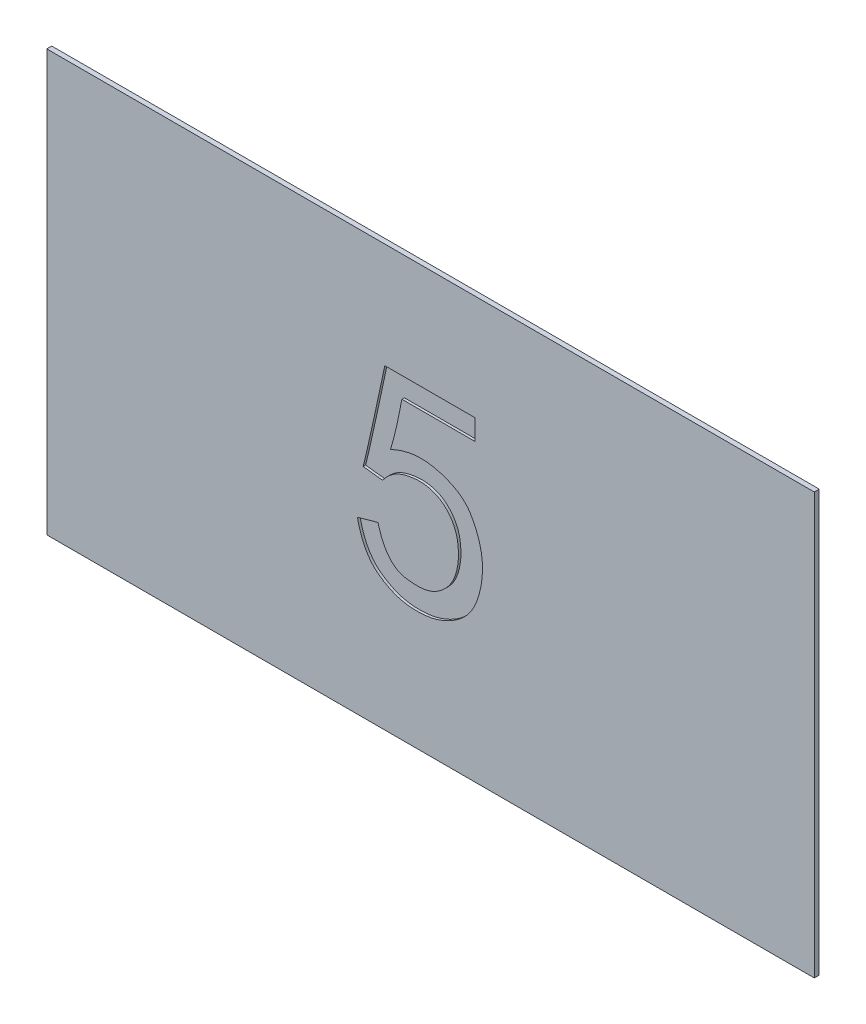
ISO-10303-21;
HEADER;
FILE_DESCRIPTION(('STEP AP214'),'2;1');
FILE_NAME('part.step','',(''),(''),'','','');
FILE_SCHEMA(('AUTOMOTIVE_DESIGN { 1 0 10303 214 1 1 1 1 }'));
ENDSEC;
DATA;
#1=APPLICATION_CONTEXT('core data for automotive mechanical design processes');
#2=APPLICATION_PROTOCOL_DEFINITION('international standard','automotive_design',2000,#1);
#3=PRODUCT_CONTEXT('',#1,'mechanical');
#4=PRODUCT('Part','Part','',(#3));
#5=PRODUCT_RELATED_PRODUCT_CATEGORY('part','',(#4));
#6=PRODUCT_DEFINITION_FORMATION('','',#4);
#7=PRODUCT_DEFINITION_CONTEXT('part definition',#1,'design');
#8=PRODUCT_DEFINITION('design','',#6,#7);
#9=PRODUCT_DEFINITION_SHAPE('','',#8);
#10=(LENGTH_UNIT() NAMED_UNIT(*) SI_UNIT(.MILLI.,.METRE.));
#11=(NAMED_UNIT(*) PLANE_ANGLE_UNIT() SI_UNIT($,.RADIAN.));
#12=(NAMED_UNIT(*) SI_UNIT($,.STERADIAN.) SOLID_ANGLE_UNIT());
#13=UNCERTAINTY_MEASURE_WITH_UNIT(LENGTH_MEASURE(1.E-05),#10,'distance_accuracy_value','');
#14=(GEOMETRIC_REPRESENTATION_CONTEXT(3) GLOBAL_UNCERTAINTY_ASSIGNED_CONTEXT((#13)) GLOBAL_UNIT_ASSIGNED_CONTEXT((#10,
#11,#12)) REPRESENTATION_CONTEXT('',''));
#15=CARTESIAN_POINT('',(0.,0.,0.));
#16=DIRECTION('',(0.,0.,1.));
#17=DIRECTION('',(1.,0.,0.));
#18=AXIS2_PLACEMENT_3D('',#15,#16,#17);
#19=CARTESIAN_POINT('',(1.09554781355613,-1.27762583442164,0.1));
#20=DIRECTION('',(0.,0.,-1.));
#21=DIRECTION('',(-1.,0.,0.));
#22=AXIS2_PLACEMENT_3D('',#19,#20,#21);
#23=PLANE('',#22);
#24=CARTESIAN_POINT('',(-1.61617177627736,1.43475023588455,0.0999999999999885));
#25=CARTESIAN_POINT('',(-1.60093963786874,1.44144651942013,0.100000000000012));
#26=CARTESIAN_POINT('',(-1.58570740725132,1.44814277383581,0.10000000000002));
#27=CARTESIAN_POINT('',(-1.55522588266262,1.46149597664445,0.100000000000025));
#28=CARTESIAN_POINT('',(-1.53997658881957,1.4681529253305,0.100000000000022));
#29=CARTESIAN_POINT('',(-1.50939221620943,1.48141074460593,0.100000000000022));
#30=CARTESIAN_POINT('',(-1.49405702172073,1.48801134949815,0.100000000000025));
#31=CARTESIAN_POINT('',(-1.46333482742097,1.50109287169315,0.100000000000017));
#32=CARTESIAN_POINT('',(-1.44794782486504,1.50757378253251,0.100000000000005));
#33=CARTESIAN_POINT('',(-1.40131552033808,1.5269346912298,0.0999999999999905));
#34=CARTESIAN_POINT('',(-1.36996733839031,1.53957093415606,0.100000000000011));
#35=CARTESIAN_POINT('',(-1.30687661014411,1.56381482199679,0.100000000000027));
#36=CARTESIAN_POINT('',(-1.27513409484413,1.57542254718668,0.100000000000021));
#37=CARTESIAN_POINT('',(-1.17923875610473,1.60839951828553,0.100000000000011));
#38=CARTESIAN_POINT('',(-1.11443701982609,1.62791438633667,0.100000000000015));
#39=CARTESIAN_POINT('',(-1.01648812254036,1.65382897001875,0.100000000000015));
#40=CARTESIAN_POINT('',(-0.983764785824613,1.66189774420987,0.100000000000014));
#41=CARTESIAN_POINT('',(-0.918075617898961,1.67697755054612,0.100000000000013));
#42=CARTESIAN_POINT('',(-0.885109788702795,1.68398859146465,0.100000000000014));
#43=CARTESIAN_POINT('',(-0.785885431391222,1.70322489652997,0.10000000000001));
#44=CARTESIAN_POINT('',(-0.719259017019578,1.71366441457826,0.100000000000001));
#45=CARTESIAN_POINT('',(-0.58499421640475,1.72844760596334,0.0999999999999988));
#46=CARTESIAN_POINT('',(-0.517352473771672,1.73276120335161,0.100000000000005));
#47=CARTESIAN_POINT('',(-0.381936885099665,1.7355531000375,0.100000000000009));
#48=CARTESIAN_POINT('',(-0.31416299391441,1.73402882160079,0.100000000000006));
#49=CARTESIAN_POINT('',(-0.178693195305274,1.72574341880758,0.100000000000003));
#50=CARTESIAN_POINT('',(-0.110998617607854,1.71896193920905,0.100000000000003));
#51=CARTESIAN_POINT('',(0.0237878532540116,1.70098671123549,0.100000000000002));
#52=CARTESIAN_POINT('',(0.0908798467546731,1.68979371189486,0.100000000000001));
#53=CARTESIAN_POINT('',(0.19355362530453,1.66904144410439,0.0999999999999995));
#54=CARTESIAN_POINT('',(0.229465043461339,1.6610900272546,0.099999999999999));
#55=CARTESIAN_POINT('',(0.30096093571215,1.6438247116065,0.0999999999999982));
#56=CARTESIAN_POINT('',(0.336545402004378,1.63451078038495,0.0999999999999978));
#57=CARTESIAN_POINT('',(0.407362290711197,1.61458053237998,0.099999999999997));
#58=CARTESIAN_POINT('',(0.442594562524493,1.60396368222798,0.0999999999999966));
#59=CARTESIAN_POINT('',(0.512663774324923,1.58149786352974,0.0999999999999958));
#60=CARTESIAN_POINT('',(0.547500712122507,1.5696488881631,0.0999999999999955));
#61=CARTESIAN_POINT('',(0.616728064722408,1.54475268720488,0.0999999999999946));
#62=CARTESIAN_POINT('',(0.651118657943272,1.53170595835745,0.0999999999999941));
#63=CARTESIAN_POINT('',(0.719398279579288,1.50435511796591,0.0999999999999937));
#64=CARTESIAN_POINT('',(0.753287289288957,1.49005095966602,0.0999999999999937));
#65=CARTESIAN_POINT('',(0.820475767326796,1.46017646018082,0.0999999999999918));
#66=CARTESIAN_POINT('',(0.853775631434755,1.44460701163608,0.0999999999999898));
#67=CARTESIAN_POINT('',(0.919687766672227,1.41208225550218,0.0999999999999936));
#68=CARTESIAN_POINT('',(0.952300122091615,1.39512711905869,0.0999999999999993));
#69=CARTESIAN_POINT('',(1.02813412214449,1.35334024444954,0.100000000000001));
#70=CARTESIAN_POINT('',(1.07099962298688,1.3278532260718,0.0999999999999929));
#71=CARTESIAN_POINT('',(1.15470307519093,1.27368612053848,0.0999999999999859));
#72=CARTESIAN_POINT('',(1.19553997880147,1.24500440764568,0.0999999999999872));
#73=CARTESIAN_POINT('',(1.27442845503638,1.18449636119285,0.0999999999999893));
#74=CARTESIAN_POINT('',(1.31249611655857,1.15269122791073,0.09999999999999));
#75=CARTESIAN_POINT('',(1.36722224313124,1.10246525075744,0.0999999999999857));
#76=CARTESIAN_POINT('',(1.38505730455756,1.08531580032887,0.0999999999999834));
#77=CARTESIAN_POINT('',(1.41986023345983,1.05015790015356,0.09999999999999));
#78=CARTESIAN_POINT('',(1.4368281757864,1.03214952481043,0.099999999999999));
#79=CARTESIAN_POINT('',(1.4738519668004,0.990680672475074,0.100000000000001));
#80=CARTESIAN_POINT('',(1.49363311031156,0.966973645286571,0.09999999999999));
#81=CARTESIAN_POINT('',(1.53159478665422,0.918310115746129,0.0999999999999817));
#82=CARTESIAN_POINT('',(1.54977498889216,0.893353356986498,0.0999999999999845));
#83=CARTESIAN_POINT('',(1.58478513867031,0.842425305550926,0.0999999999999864));
#84=CARTESIAN_POINT('',(1.60161159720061,0.816451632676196,0.0999999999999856));
#85=CARTESIAN_POINT('',(1.63404308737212,0.763749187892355,0.0999999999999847));
#86=CARTESIAN_POINT('',(1.64964785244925,0.737020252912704,0.0999999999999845));
#87=CARTESIAN_POINT('',(1.69528493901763,0.655613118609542,0.0999999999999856));
#88=CARTESIAN_POINT('',(1.7238655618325,0.600132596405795,0.0999999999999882));
#89=CARTESIAN_POINT('',(1.7658071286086,0.516521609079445,0.0999999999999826));
#90=CARTESIAN_POINT('',(1.77962395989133,0.488604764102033,0.0999999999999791));
#91=CARTESIAN_POINT('',(1.80661150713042,0.432460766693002,0.0999999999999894));
#92=CARTESIAN_POINT('',(1.81978235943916,0.404233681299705,0.100000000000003));
#93=CARTESIAN_POINT('',(1.84121070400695,0.356117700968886,0.099999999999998));
#94=CARTESIAN_POINT('',(1.84972955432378,0.336345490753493,0.0999999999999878));
#95=CARTESIAN_POINT('',(1.86620406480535,0.296567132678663,0.0999999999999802));
#96=CARTESIAN_POINT('',(1.87415970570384,0.276560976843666,0.0999999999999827));
#97=CARTESIAN_POINT('',(1.89733418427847,0.216266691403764,0.0999999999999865));
#98=CARTESIAN_POINT('',(1.91185650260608,0.175712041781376,0.0999999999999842));
#99=CARTESIAN_POINT('',(1.93277552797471,0.114717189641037,0.0999999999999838));
#100=CARTESIAN_POINT('',(1.93958680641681,0.0944147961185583,0.0999999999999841));
#101=CARTESIAN_POINT('',(1.95294021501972,0.0537216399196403,0.0999999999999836));
#102=CARTESIAN_POINT('',(1.95948235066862,0.0333308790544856,0.0999999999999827));
#103=CARTESIAN_POINT('',(1.97856712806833,-0.0280087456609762,0.0999999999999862));
#104=CARTESIAN_POINT('',(1.99056958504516,-0.0691290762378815,0.0999999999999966));
#105=CARTESIAN_POINT('',(2.02202146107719,-0.187703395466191,0.100000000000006));
#106=CARTESIAN_POINT('',(2.0389410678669,-0.265842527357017,0.0999999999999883));
#107=CARTESIAN_POINT('',(2.05986468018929,-0.383812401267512,0.0999999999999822));
#108=CARTESIAN_POINT('',(2.06609806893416,-0.423277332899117,0.0999999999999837));
#109=CARTESIAN_POINT('',(2.07688508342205,-0.502435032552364,0.0999999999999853));
#110=CARTESIAN_POINT('',(2.08143907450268,-0.542127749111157,0.0999999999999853));
#111=CARTESIAN_POINT('',(2.09246378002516,-0.661774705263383,0.0999999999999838));
#112=CARTESIAN_POINT('',(2.09623862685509,-0.74197795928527,0.0999999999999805));
#113=CARTESIAN_POINT('',(2.09853220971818,-0.902417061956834,0.0999999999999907));
#114=CARTESIAN_POINT('',(2.09705073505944,-0.982652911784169,0.100000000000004));
#115=CARTESIAN_POINT('',(2.09125269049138,-1.10660975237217,0.0999999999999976));
#116=CARTESIAN_POINT('',(2.08852424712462,-1.15040844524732,0.0999999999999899));
#117=CARTESIAN_POINT('',(2.08127074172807,-1.23785389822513,0.0999999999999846));
#118=CARTESIAN_POINT('',(2.07674616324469,-1.28150069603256,0.0999999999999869));
#119=CARTESIAN_POINT('',(2.06557967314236,-1.36852573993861,0.0999999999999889));
#120=CARTESIAN_POINT('',(2.05893753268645,-1.41190395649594,0.0999999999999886));
#121=CARTESIAN_POINT('',(2.04402857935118,-1.49838441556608,0.0999999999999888));
#122=CARTESIAN_POINT('',(2.03576129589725,-1.54148657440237,0.0999999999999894));
#123=CARTESIAN_POINT('',(2.00905736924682,-1.67036734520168,0.0999999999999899));
#124=CARTESIAN_POINT('',(1.98871333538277,-1.7557566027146,0.0999999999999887));
#125=CARTESIAN_POINT('',(1.94257190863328,-1.92506934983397,0.099999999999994));
#126=CARTESIAN_POINT('',(1.91677539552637,-2.00899307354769,0.1));
#127=CARTESIAN_POINT('',(1.86640512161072,-2.15065457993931,0.0999999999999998));
#128=CARTESIAN_POINT('',(1.84359407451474,-2.20901309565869,0.099999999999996));
#129=CARTESIAN_POINT('',(1.79377025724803,-2.32390320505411,0.0999999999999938));
#130=CARTESIAN_POINT('',(1.76675893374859,-2.38043541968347,0.0999999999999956));
#131=CARTESIAN_POINT('',(1.70827814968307,-2.49078593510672,0.0999999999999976));
#132=CARTESIAN_POINT('',(1.67683268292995,-2.54461685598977,0.099999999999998));
#133=CARTESIAN_POINT('',(1.60920096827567,-2.64920771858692,0.0999999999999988));
#134=CARTESIAN_POINT('',(1.57301578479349,-2.69996834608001,0.0999999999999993));
#135=CARTESIAN_POINT('',(1.49582064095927,-2.79811185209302,0.100000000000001));
#136=CARTESIAN_POINT('',(1.45478705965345,-2.84547622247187,0.100000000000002));
#137=CARTESIAN_POINT('',(1.39009253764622,-2.91350611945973,0.100000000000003));
#138=CARTESIAN_POINT('',(1.36799889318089,-2.93568414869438,0.100000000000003));
#139=CARTESIAN_POINT('',(1.32282283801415,-2.97901226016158,0.100000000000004));
#140=CARTESIAN_POINT('',(1.29974038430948,-3.00016229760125,0.100000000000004));
#141=CARTESIAN_POINT('',(1.22898803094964,-3.06228749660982,0.100000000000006));
#142=CARTESIAN_POINT('',(1.17998942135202,-3.10175432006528,0.100000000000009));
#143=CARTESIAN_POINT('',(1.07932575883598,-3.17709086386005,0.100000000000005));
#144=CARTESIAN_POINT('',(1.02766074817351,-3.21296064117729,0.0999999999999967));
#145=CARTESIAN_POINT('',(0.941952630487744,-3.26828128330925,0.100000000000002));
#146=CARTESIAN_POINT('',(0.90860917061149,-3.28882393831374,0.100000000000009));
#147=CARTESIAN_POINT('',(0.841129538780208,-3.32854019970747,0.100000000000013));
#148=CARTESIAN_POINT('',(0.806993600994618,-3.34771420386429,0.100000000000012));
#149=CARTESIAN_POINT('',(0.738102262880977,-3.38467769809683,0.100000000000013));
#150=CARTESIAN_POINT('',(0.703348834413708,-3.40247086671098,0.100000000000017));
#151=CARTESIAN_POINT('',(0.633184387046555,-3.43673969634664,0.100000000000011));
#152=CARTESIAN_POINT('',(0.597773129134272,-3.45321486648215,0.100000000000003));
#153=CARTESIAN_POINT('',(0.496268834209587,-3.49788559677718,0.0999999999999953));
#154=CARTESIAN_POINT('',(0.429378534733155,-3.5243073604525,0.100000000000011));
#155=CARTESIAN_POINT('',(0.293608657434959,-3.57136255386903,0.100000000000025));
#156=CARTESIAN_POINT('',(0.224729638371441,-3.59199759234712,0.100000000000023));
#157=CARTESIAN_POINT('',(0.0851627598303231,-3.62718000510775,0.100000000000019));
#158=CARTESIAN_POINT('',(0.0144693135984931,-3.6417053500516,0.100000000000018));
#159=CARTESIAN_POINT('',(-0.0922909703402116,-3.65898863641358,0.100000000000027));
#160=CARTESIAN_POINT('',(-0.128010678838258,-3.66399993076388,0.100000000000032));
#161=CARTESIAN_POINT('',(-0.199625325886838,-3.67257539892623,0.100000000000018));
#162=CARTESIAN_POINT('',(-0.23552026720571,-3.67613954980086,0.0999999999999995));
#163=CARTESIAN_POINT('',(-0.307551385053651,-3.68199948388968,0.1));
#164=CARTESIAN_POINT('',(-0.343687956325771,-3.68429026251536,0.100000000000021));
#165=CARTESIAN_POINT('',(-0.416014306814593,-3.68776622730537,0.100000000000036));
#166=CARTESIAN_POINT('',(-0.452204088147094,-3.6889513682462,0.100000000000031));
#167=CARTESIAN_POINT('',(-0.524607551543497,-3.69028672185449,0.100000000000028));
#168=CARTESIAN_POINT('',(-0.56082123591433,-3.69043681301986,0.10000000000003));
#169=CARTESIAN_POINT('',(-0.633234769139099,-3.68954364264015,0.100000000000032));
#170=CARTESIAN_POINT('',(-0.669434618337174,-3.68850041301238,0.100000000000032));
#171=CARTESIAN_POINT('',(-0.741745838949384,-3.68510409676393,0.100000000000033));
#172=CARTESIAN_POINT('',(-0.777857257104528,-3.68275202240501,0.100000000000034));
#173=CARTESIAN_POINT('',(-0.849957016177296,-3.67660926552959,0.100000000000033));
#174=CARTESIAN_POINT('',(-0.885945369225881,-3.67281872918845,0.100000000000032));
#175=CARTESIAN_POINT('',(-0.95767789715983,-3.66354926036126,0.100000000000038));
#176=CARTESIAN_POINT('',(-0.993422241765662,-3.65807165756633,0.100000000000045));
#177=CARTESIAN_POINT('',(-1.06463131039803,-3.64553384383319,0.100000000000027));
#178=CARTESIAN_POINT('',(-1.1000959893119,-3.63847338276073,0.100000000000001));
#179=CARTESIAN_POINT('',(-1.17606317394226,-3.62183325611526,0.099999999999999));
#180=CARTESIAN_POINT('',(-1.21651934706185,-3.61203428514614,0.100000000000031));
#181=CARTESIAN_POINT('',(-1.27664037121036,-3.59530704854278,0.100000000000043));
#182=CARTESIAN_POINT('',(-1.29658609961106,-3.5893934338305,0.10000000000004));
#183=CARTESIAN_POINT('',(-1.3362569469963,-3.57686509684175,0.100000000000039));
#184=CARTESIAN_POINT('',(-1.35598204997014,-3.5702503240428,0.10000000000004));
#185=CARTESIAN_POINT('',(-1.39524791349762,-3.55645906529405,0.100000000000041));
#186=CARTESIAN_POINT('',(-1.41478854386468,-3.54928221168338,0.100000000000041));
#187=CARTESIAN_POINT('',(-1.45370627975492,-3.53449971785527,0.100000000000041));
#188=CARTESIAN_POINT('',(-1.47308338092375,-3.52689406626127,0.100000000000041));
#189=CARTESIAN_POINT('',(-1.53098536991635,-3.5034814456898,0.100000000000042));
#190=CARTESIAN_POINT('',(-1.56927392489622,-3.48708132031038,0.100000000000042));
#191=CARTESIAN_POINT('',(-1.64501030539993,-3.45243974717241,0.100000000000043));
#192=CARTESIAN_POINT('',(-1.68245814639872,-3.43419833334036,0.100000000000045));
#193=CARTESIAN_POINT('',(-1.7563878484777,-3.39586699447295,0.100000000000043));
#194=CARTESIAN_POINT('',(-1.79286987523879,-3.37577738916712,0.10000000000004));
#195=CARTESIAN_POINT('',(-1.86482864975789,-3.33389186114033,0.100000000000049));
#196=CARTESIAN_POINT('',(-1.90030550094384,-3.31209611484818,0.100000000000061));
#197=CARTESIAN_POINT('',(-1.97040695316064,-3.26716440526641,0.100000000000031));
#198=CARTESIAN_POINT('',(-2.0050314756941,-3.24402831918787,0.0999999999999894));
#199=CARTESIAN_POINT('',(-2.06144608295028,-3.20425651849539,0.100000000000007));
#200=CARTESIAN_POINT('',(-2.08357556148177,-3.18810390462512,0.100000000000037));
#201=CARTESIAN_POINT('',(-2.12718907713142,-3.15495499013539,0.100000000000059));
#202=CARTESIAN_POINT('',(-2.14867323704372,-3.13795885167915,0.100000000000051));
#203=CARTESIAN_POINT('',(-2.19083878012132,-3.10305077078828,0.100000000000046));
#204=CARTESIAN_POINT('',(-2.21152122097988,-3.08514011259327,0.100000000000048));
#205=CARTESIAN_POINT('',(-2.25193625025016,-3.04827520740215,0.10000000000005));
#206=CARTESIAN_POINT('',(-2.27166883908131,-3.02932096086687,0.10000000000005));
#207=CARTESIAN_POINT('',(-2.31006141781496,-2.99053700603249,0.100000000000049));
#208=CARTESIAN_POINT('',(-2.32872609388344,-2.97071192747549,0.100000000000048));
#209=CARTESIAN_POINT('',(-2.36513241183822,-2.9302324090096,0.100000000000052));
#210=CARTESIAN_POINT('',(-2.38287393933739,-2.9095778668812,0.100000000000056));
#211=CARTESIAN_POINT('',(-2.43480040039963,-2.84645281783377,0.100000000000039));
#212=CARTESIAN_POINT('',(-2.46764464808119,-2.80286447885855,0.0999999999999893));
#213=CARTESIAN_POINT('',(-2.51870053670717,-2.72903092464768,0.100000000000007));
#214=CARTESIAN_POINT('',(-2.53798183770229,-2.69951311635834,0.100000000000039));
#215=CARTESIAN_POINT('',(-2.57514210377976,-2.63959482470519,0.100000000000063));
#216=CARTESIAN_POINT('',(-2.59302057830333,-2.60919403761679,0.100000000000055));
#217=CARTESIAN_POINT('',(-2.62757916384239,-2.547739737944,0.100000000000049));
#218=CARTESIAN_POINT('',(-2.64425978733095,-2.51668651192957,0.100000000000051));
#219=CARTESIAN_POINT('',(-2.67637077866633,-2.45395069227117,0.100000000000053));
#220=CARTESIAN_POINT('',(-2.6918015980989,-2.4222683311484,0.100000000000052));
#221=CARTESIAN_POINT('',(-2.72127881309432,-2.3579899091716,0.100000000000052));
#222=CARTESIAN_POINT('',(-2.73531451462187,-2.32538893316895,0.100000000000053));
#223=CARTESIAN_POINT('',(-2.76200530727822,-2.2596217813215,0.100000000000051));
#224=CARTESIAN_POINT('',(-2.77465999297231,-2.22645544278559,0.100000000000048));
#225=CARTESIAN_POINT('',(-2.79906832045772,-2.15979887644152,0.100000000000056));
#226=CARTESIAN_POINT('',(-2.81082198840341,-2.12630865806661,0.100000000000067));
#227=CARTESIAN_POINT('',(-2.83365995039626,-2.05910494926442,0.100000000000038));
#228=CARTESIAN_POINT('',(-2.84474433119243,-2.02539148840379,0.0999999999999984));
#229=CARTESIAN_POINT('',(-2.86525685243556,-1.95984064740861,0.100000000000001));
#230=CARTESIAN_POINT('',(-2.87474570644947,-1.92802251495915,0.100000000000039));
#231=CARTESIAN_POINT('',(-2.89260653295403,-1.86408482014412,0.100000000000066));
#232=CARTESIAN_POINT('',(-2.9009788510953,-1.83196535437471,0.100000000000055));
#233=CARTESIAN_POINT('',(-2.91680718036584,-1.76784779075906,0.10000000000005));
#234=CARTESIAN_POINT('',(-2.92427153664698,-1.73585170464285,0.100000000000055));
#235=CARTESIAN_POINT('',(-2.93880347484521,-1.67175837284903,0.100000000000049));
#236=CARTESIAN_POINT('',(-2.94587093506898,-1.63966109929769,0.100000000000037));
#237=CARTESIAN_POINT('',(-2.95294941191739,-1.60757127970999,0.1));
#238=B_SPLINE_CURVE_WITH_KNOTS('',3,(#24,#25,#26,#27,#28,#29,#30,#31,#32,#33,#34,#35,#36,#37,
#38,#39,#40,#41,#42,#43,#44,#45,#46,#47,#48,#49,#50,#51,#52,#53,#54,#55,#56,#57,#58,#59,#60,#61,
#62,#63,#64,#65,#66,#67,#68,#69,#70,#71,#72,#73,#74,#75,#76,#77,#78,#79,#80,#81,#82,#83,#84,#85,
#86,#87,#88,#89,#90,#91,#92,#93,#94,#95,#96,#97,#98,#99,#100,#101,#102,#103,#104,#105,#106,#107,
#108,#109,#110,#111,#112,#113,#114,#115,#116,#117,#118,#119,#120,#121,#122,#123,#124,#125,#126,
#127,#128,#129,#130,#131,#132,#133,#134,#135,#136,#137,#138,#139,#140,#141,#142,#143,#144,#145,
#146,#147,#148,#149,#150,#151,#152,#153,#154,#155,#156,#157,#158,#159,#160,#161,#162,#163,#164,
#165,#166,#167,#168,#169,#170,#171,#172,#173,#174,#175,#176,#177,#178,#179,#180,#181,#182,#183,
#184,#185,#186,#187,#188,#189,#190,#191,#192,#193,#194,#195,#196,#197,#198,#199,#200,#201,#202,
#203,#204,#205,#206,#207,#208,#209,#210,#211,#212,#213,#214,#215,#216,#217,#218,#219,#220,#221,
#222,#223,#224,#225,#226,#227,#228,#229,#230,#231,#232,#233,#234,#235,#236,#237),.UNSPECIFIED.,
.F.,.F.,(4,2,2,2,2,2,2,2,2,2,2,2,2,2,2,2,2,2,2,2,2,2,2,2,2,2,2,2,2,2,2,2,2,2,2,2,2,2,2,2,2,2,2,
2,2,2,2,2,2,2,2,2,2,2,2,2,2,2,2,2,2,2,2,2,2,2,2,2,2,2,2,2,2,2,2,2,2,2,2,2,2,2,2,2,2,2,2,2,2,2,2,
2,2,2,2,2,2,2,2,2,2,2,2,2,2,2,4),(0.,0.0499172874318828,0.0998342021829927,0.149919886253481,
0.200008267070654,0.30139219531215,0.402768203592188,0.605581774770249,0.706679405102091,
0.807776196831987,1.00984257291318,1.21289762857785,1.41604235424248,1.61997758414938,
1.82387820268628,1.93419830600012,2.04452103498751,2.15488907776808,2.26525773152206,
2.37558081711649,2.48590800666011,2.59615802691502,2.70639445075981,2.85587409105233,
3.00543015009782,3.15403331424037,3.22823614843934,3.30243256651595,3.39498658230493,
3.48755966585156,3.58036416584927,3.67318885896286,3.86033409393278,3.95378367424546,
4.04721344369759,4.1117935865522,4.17637593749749,4.30557105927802,4.36981425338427,
4.43405613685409,4.56252679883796,4.80203670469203,4.92188058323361,5.04169837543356,
5.28230534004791,5.52292194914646,5.65454980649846,5.78614225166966,5.91774892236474,
6.04939375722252,6.31257339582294,6.57571060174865,6.76354451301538,6.95131387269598,
7.13810361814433,7.32485148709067,7.51254991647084,7.60643705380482,7.70032827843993,
7.8888712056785,8.07741114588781,8.19487145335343,8.31229748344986,8.42939911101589,
8.5465441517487,8.76204728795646,8.97749045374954,9.19370390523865,9.301888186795,
9.41007418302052,9.51868241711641,9.62729509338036,9.73592051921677,9.84454303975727,
9.95308166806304,10.0616092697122,10.1700515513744,10.2785109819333,10.4033174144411,
10.4657159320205,10.5281189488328,10.5905631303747,10.653008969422,10.7779229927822,
10.90283471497,11.0277248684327,11.1526021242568,11.277490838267,11.3596657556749,
11.4418249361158,11.5238717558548,11.6059185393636,11.6875722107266,11.7692359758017,
11.9327456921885,12.0384799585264,12.1442510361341,12.2499765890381,12.3556637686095,
12.4621070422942,12.5685814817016,12.6750528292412,12.7815103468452,12.8811014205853,
12.9806615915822,13.0792235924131,13.1778156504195),.UNSPECIFIED.);
#239=CARTESIAN_POINT('',(-1.61617177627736,1.43475023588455,0.0999999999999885));
#240=VERTEX_POINT('',#239);
#241=CARTESIAN_POINT('',(-2.95294941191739,-1.60757127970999,0.099999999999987));
#242=VERTEX_POINT('',#241);
#243=EDGE_CURVE('E24',#240,#242,#238,.T.);
#244=ORIENTED_EDGE('',*,*,#243,.F.);
#245=CARTESIAN_POINT('',(-1.15521397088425,3.41686879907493,0.0999999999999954));
#246=CARTESIAN_POINT('',(-1.1614518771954,3.38412502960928,0.10000000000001));
#247=CARTESIAN_POINT('',(-1.1676967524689,3.35138254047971,0.100000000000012));
#248=CARTESIAN_POINT('',(-1.18019382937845,3.28589764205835,0.100000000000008));
#249=CARTESIAN_POINT('',(-1.18644603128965,3.25315523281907,0.100000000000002));
#250=CARTESIAN_POINT('',(-1.2052050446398,3.15491741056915,0.0999999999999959));
#251=CARTESIAN_POINT('',(-1.21771219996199,3.0894222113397,0.100000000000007));
#252=CARTESIAN_POINT('',(-1.24306236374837,2.95849696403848,0.100000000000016));
#253=CARTESIAN_POINT('',(-1.25590536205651,2.89306691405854,0.100000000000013));
#254=CARTESIAN_POINT('',(-1.27596027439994,2.79508339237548,0.100000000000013));
#255=CARTESIAN_POINT('',(-1.28277692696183,2.76244938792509,0.100000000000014));
#256=CARTESIAN_POINT('',(-1.29660981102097,2.69722344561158,0.100000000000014));
#257=CARTESIAN_POINT('',(-1.30362604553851,2.66463150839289,0.100000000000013));
#258=CARTESIAN_POINT('',(-1.31779091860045,2.59947632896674,0.100000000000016));
#259=CARTESIAN_POINT('',(-1.32493955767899,2.56691308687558,0.100000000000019));
#260=CARTESIAN_POINT('',(-1.3393311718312,2.50180764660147,0.100000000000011));
#261=CARTESIAN_POINT('',(-1.34657414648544,2.46926544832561,0.100000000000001));
#262=CARTESIAN_POINT('',(-1.36338716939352,2.39466042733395,0.0999999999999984));
#263=CARTESIAN_POINT('',(-1.3730154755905,2.35261060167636,0.100000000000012));
#264=CARTESIAN_POINT('',(-1.39272945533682,2.2686184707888,0.100000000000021));
#265=CARTESIAN_POINT('',(-1.40281512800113,2.22667616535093,0.100000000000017));
#266=CARTESIAN_POINT('',(-1.42322604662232,2.14285270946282,0.100000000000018));
#267=CARTESIAN_POINT('',(-1.4335512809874,2.10097155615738,0.100000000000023));
#268=CARTESIAN_POINT('',(-1.45418185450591,2.0172042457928,0.100000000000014));
#269=CARTESIAN_POINT('',(-1.46448719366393,1.97531808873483,0.0999999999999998));
#270=CARTESIAN_POINT('',(-1.48556372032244,1.89159770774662,0.1));
#271=CARTESIAN_POINT('',(-1.49633555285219,1.84976364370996,0.100000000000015));
#272=CARTESIAN_POINT('',(-1.51865436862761,1.76630268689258,0.100000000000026));
#273=CARTESIAN_POINT('',(-1.53020133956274,1.72467579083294,0.100000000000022));
#274=CARTESIAN_POINT('',(-1.55395544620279,1.64160813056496,0.100000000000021));
#275=CARTESIAN_POINT('',(-1.56616264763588,1.60016738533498,0.100000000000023));
#276=CARTESIAN_POINT('',(-1.59095472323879,1.51739541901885,0.100000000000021));
#277=CARTESIAN_POINT('',(-1.60353962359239,1.47606420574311,0.100000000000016));
#278=CARTESIAN_POINT('',(-1.61617177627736,1.43475023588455,0.1));
#279=B_SPLINE_CURVE_WITH_KNOTS('',3,(#245,#246,#247,#248,#249,#250,#251,#252,#253,#254,#255,
#256,#257,#258,#259,#260,#261,#262,#263,#264,#265,#266,#267,#268,#269,#270,#271,#272,#273,#274,
#275,#276,#277,#278),.UNSPECIFIED.,.F.,.F.,(4,2,2,2,2,2,2,2,2,2,2,2,2,2,2,2,4),(0.,
0.0999980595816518,0.200000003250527,0.400036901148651,0.600067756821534,0.700081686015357,
0.800097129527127,0.900112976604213,1.00012837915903,1.12954043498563,1.2589522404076,
1.38835779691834,1.51776332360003,1.6473538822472,1.77694238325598,1.90654380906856,
2.03615424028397),.UNSPECIFIED.);
#280=CARTESIAN_POINT('',(-1.15521397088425,3.41686879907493,0.100000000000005));
#281=VERTEX_POINT('',#280);
#282=EDGE_CURVE('E118',#281,#240,#279,.T.);
#283=ORIENTED_EDGE('',*,*,#282,.F.);
#284=DIRECTION('',(1.,0.,0.));
#285=VECTOR('',#284,1.);
#286=CARTESIAN_POINT('',(1.79491598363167,3.41686879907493,0.1));
#287=LINE('',#286,#285);
#288=CARTESIAN_POINT('',(1.79491598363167,3.41686879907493,0.1));
#289=VERTEX_POINT('',#288);
#290=EDGE_CURVE('E147',#289,#281,#287,.F.);
#291=ORIENTED_EDGE('',*,*,#290,.F.);
#292=DIRECTION('',(0.,1.,0.));
#293=VECTOR('',#292,1.);
#294=CARTESIAN_POINT('',(1.79491598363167,4.24659284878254,0.1));
#295=LINE('',#294,#293);
#296=CARTESIAN_POINT('',(1.79491598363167,4.24659284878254,0.1));
#297=VERTEX_POINT('',#296);
#298=EDGE_CURVE('E151',#297,#289,#295,.F.);
#299=ORIENTED_EDGE('',*,*,#298,.F.);
#300=DIRECTION('',(1.,0.,0.));
#301=VECTOR('',#300,1.);
#302=CARTESIAN_POINT('',(-1.84665067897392,4.24659284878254,0.1));
#303=LINE('',#302,#301);
#304=CARTESIAN_POINT('',(-1.84665067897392,4.24659284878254,0.0999999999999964));
#305=VERTEX_POINT('',#304);
#306=EDGE_CURVE('E163',#305,#297,#303,.T.);
#307=ORIENTED_EDGE('',*,*,#306,.F.);
#308=CARTESIAN_POINT('',(-2.72247050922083,0.282355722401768,0.0999999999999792));
#309=CARTESIAN_POINT('',(-2.72017168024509,0.290371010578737,0.100000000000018));
#310=CARTESIAN_POINT('',(-2.7178744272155,0.298386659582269,0.100000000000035));
#311=CARTESIAN_POINT('',(-2.71329053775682,0.314421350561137,0.100000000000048));
#312=CARTESIAN_POINT('',(-2.71100390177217,0.322440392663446,0.100000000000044));
#313=CARTESIAN_POINT('',(-2.70417320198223,0.346499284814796,0.100000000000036));
#314=CARTESIAN_POINT('',(-2.699656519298,0.362547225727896,0.100000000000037));
#315=CARTESIAN_POINT('',(-2.69099428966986,0.394745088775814,0.100000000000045));
#316=CARTESIAN_POINT('',(-2.68684875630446,0.410895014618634,0.100000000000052));
#317=CARTESIAN_POINT('',(-2.67894505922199,0.443289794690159,0.100000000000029));
#318=CARTESIAN_POINT('',(-2.67518694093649,0.459534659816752,0.1));
#319=CARTESIAN_POINT('',(-2.66767046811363,0.492016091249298,0.0999999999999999));
#320=CARTESIAN_POINT('',(-2.6639121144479,0.508252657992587,0.100000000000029));
#321=CARTESIAN_POINT('',(-2.6562476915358,0.540690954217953,0.10000000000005));
#322=CARTESIAN_POINT('',(-2.65234162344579,0.556892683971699,0.100000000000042));
#323=CARTESIAN_POINT('',(-2.64450297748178,0.589289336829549,0.100000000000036));
#324=CARTESIAN_POINT('',(-2.64057039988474,0.605484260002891,0.100000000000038));
#325=CARTESIAN_POINT('',(-2.63276476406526,0.637888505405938,0.10000000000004));
#326=CARTESIAN_POINT('',(-2.6288917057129,0.654097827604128,0.100000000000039));
#327=CARTESIAN_POINT('',(-2.61737936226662,0.702749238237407,0.100000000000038));
#328=CARTESIAN_POINT('',(-2.6098464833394,0.735216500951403,0.100000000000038));
#329=CARTESIAN_POINT('',(-2.59868902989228,0.783950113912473,0.100000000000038));
#330=CARTESIAN_POINT('',(-2.59499347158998,0.800200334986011,0.100000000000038));
#331=CARTESIAN_POINT('',(-2.58763170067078,0.832707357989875,0.100000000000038));
#332=CARTESIAN_POINT('',(-2.58396548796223,0.848964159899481,0.100000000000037));
#333=CARTESIAN_POINT('',(-2.57296992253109,0.897742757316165,0.100000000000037));
#334=CARTESIAN_POINT('',(-2.56564523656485,0.930265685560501,0.100000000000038));
#335=CARTESIAN_POINT('',(-2.55078966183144,0.995264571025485,0.100000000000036));
#336=CARTESIAN_POINT('',(-2.54325877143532,1.02774052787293,0.100000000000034));
#337=CARTESIAN_POINT('',(-2.52822535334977,1.09269858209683,0.100000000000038));
#338=CARTESIAN_POINT('',(-2.52072282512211,1.12518067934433,0.100000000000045));
#339=CARTESIAN_POINT('',(-2.50605895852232,1.19022151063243,0.100000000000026));
#340=CARTESIAN_POINT('',(-2.49889761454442,1.22278024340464,0.1));
#341=CARTESIAN_POINT('',(-2.48475987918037,1.28793578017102,0.0999999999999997));
#342=CARTESIAN_POINT('',(-2.47778347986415,1.32053258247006,0.100000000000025));
#343=CARTESIAN_POINT('',(-2.46371270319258,1.3857010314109,0.100000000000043));
#344=CARTESIAN_POINT('',(-2.45661832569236,1.41827267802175,0.100000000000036));
#345=CARTESIAN_POINT('',(-2.44221744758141,1.48336872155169,0.100000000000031));
#346=CARTESIAN_POINT('',(-2.43491094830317,1.51589311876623,0.100000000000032));
#347=CARTESIAN_POINT('',(-2.42025923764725,1.58093335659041,0.100000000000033));
#348=CARTESIAN_POINT('',(-2.41291402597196,1.61344919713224,0.100000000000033));
#349=CARTESIAN_POINT('',(-2.39106949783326,1.71103347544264,0.10000000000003));
#350=CARTESIAN_POINT('',(-2.37675994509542,1.77614445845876,0.100000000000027));
#351=CARTESIAN_POINT('',(-2.35546715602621,1.87384781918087,0.100000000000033));
#352=CARTESIAN_POINT('',(-2.34839814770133,1.90642176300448,0.100000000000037));
#353=CARTESIAN_POINT('',(-2.33424611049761,1.97156661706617,0.100000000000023));
#354=CARTESIAN_POINT('',(-2.32716308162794,2.00413752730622,0.100000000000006));
#355=CARTESIAN_POINT('',(-2.30590078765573,2.10184926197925,0.0999999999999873));
#356=CARTESIAN_POINT('',(-2.2917087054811,2.16698729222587,0.100000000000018));
#357=CARTESIAN_POINT('',(-2.26343841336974,2.29728806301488,0.100000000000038));
#358=CARTESIAN_POINT('',(-2.24936020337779,2.36245080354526,0.100000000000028));
#359=CARTESIAN_POINT('',(-2.22131759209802,2.49280229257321,0.100000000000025));
#360=CARTESIAN_POINT('',(-2.20735319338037,2.55799104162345,0.100000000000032));
#361=CARTESIAN_POINT('',(-2.17950766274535,2.68838634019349,0.100000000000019));
#362=CARTESIAN_POINT('',(-2.16562653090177,2.75359288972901,0.0999999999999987));
#363=CARTESIAN_POINT('',(-2.13775724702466,2.88398263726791,0.100000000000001));
#364=CARTESIAN_POINT('',(-2.12376909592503,2.94916583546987,0.100000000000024));
#365=CARTESIAN_POINT('',(-2.09557579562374,3.07948473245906,0.100000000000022));
#366=CARTESIAN_POINT('',(-2.08137064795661,3.14462043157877,0.0999999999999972));
#367=CARTESIAN_POINT('',(-2.05785414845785,3.25293087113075,0.100000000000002));
#368=CARTESIAN_POINT('',(-2.04850914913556,3.29609828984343,0.100000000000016));
#369=CARTESIAN_POINT('',(-2.02997343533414,3.38246621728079,0.100000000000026));
#370=CARTESIAN_POINT('',(-2.02078272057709,3.42566672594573,0.100000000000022));
#371=CARTESIAN_POINT('',(-1.99338756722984,3.55530613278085,0.100000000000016));
#372=CARTESIAN_POINT('',(-1.9753602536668,3.64178229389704,0.100000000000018));
#373=CARTESIAN_POINT('',(-1.94813039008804,3.77145777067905,0.100000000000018));
#374=CARTESIAN_POINT('',(-1.93902219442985,3.8146769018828,0.100000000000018));
#375=CARTESIAN_POINT('',(-1.9207094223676,3.90109475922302,0.100000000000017));
#376=CARTESIAN_POINT('',(-1.91150484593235,3.94429348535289,0.100000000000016));
#377=CARTESIAN_POINT('',(-1.89304003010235,4.03067883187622,0.100000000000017));
#378=CARTESIAN_POINT('',(-1.88377979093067,4.07386545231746,0.100000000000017));
#379=CARTESIAN_POINT('',(-1.86523031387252,4.16023241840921,0.100000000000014));
#380=CARTESIAN_POINT('',(-1.85594107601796,4.20341276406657,0.10000000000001));
#381=CARTESIAN_POINT('',(-1.84665067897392,4.24659284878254,0.1));
#382=B_SPLINE_CURVE_WITH_KNOTS('',3,(#308,#309,#310,#311,#312,#313,#314,#315,#316,#317,#318,
#319,#320,#321,#322,#323,#324,#325,#326,#327,#328,#329,#330,#331,#332,#333,#334,#335,#336,#337,
#338,#339,#340,#341,#342,#343,#344,#345,#346,#347,#348,#349,#350,#351,#352,#353,#354,#355,#356,
#357,#358,#359,#360,#361,#362,#363,#364,#365,#366,#367,#368,#369,#370,#371,#372,#373,#374,#375,
#376,#377,#378,#379,#380,#381),.UNSPECIFIED.,.F.,.F.,(4,2,2,2,2,2,2,2,2,2,2,2,2,2,2,2,2,2,2,2,2,
2,2,2,2,2,2,2,2,2,2,2,2,2,2,2,4),(0.,0.0250151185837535,0.0500312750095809,0.100043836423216,
0.150058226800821,0.200078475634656,0.250076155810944,0.300073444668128,0.350070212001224,
0.400066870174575,0.500054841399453,0.550050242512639,0.600045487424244,0.700057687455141,
0.800070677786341,0.900081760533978,1.00009119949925,1.10009634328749,1.20010160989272,
1.30010624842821,1.4001116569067,1.60010464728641,1.70010119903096,1.8000976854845,
2.00009617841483,2.20009457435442,2.40009747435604,2.60010055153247,2.8001018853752,
3.0001018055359,3.13260373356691,3.26510542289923,3.53011069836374,3.66261599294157,
3.79512133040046,3.92762613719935,4.06013079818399),.UNSPECIFIED.);
#383=CARTESIAN_POINT('',(-2.72247050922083,0.282355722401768,0.100000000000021));
#384=VERTEX_POINT('',#383);
#385=EDGE_CURVE('E169',#384,#305,#382,.T.);
#386=ORIENTED_EDGE('',*,*,#385,.F.);
#387=DIRECTION('',(-0.993150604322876,0.116841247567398,0.));
#388=VECTOR('',#387,1.);
#389=CARTESIAN_POINT('',(-1.93884224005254,0.190164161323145,0.1));
#390=LINE('',#389,#388);
#391=CARTESIAN_POINT('',(-1.93884224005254,0.190164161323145,0.099999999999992));
#392=VERTEX_POINT('',#391);
#393=EDGE_CURVE('E173',#392,#384,#390,.T.);
#394=ORIENTED_EDGE('',*,*,#393,.F.);
#395=CARTESIAN_POINT('',(-2.12322536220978,-1.37709237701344,0.0999999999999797));
#396=CARTESIAN_POINT('',(-2.11879223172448,-1.39311713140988,0.100000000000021));
#397=CARTESIAN_POINT('',(-2.11435907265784,-1.40914197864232,0.100000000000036));
#398=CARTESIAN_POINT('',(-2.10544607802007,-1.44117846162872,0.100000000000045));
#399=CARTESIAN_POINT('',(-2.10096624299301,-1.45719009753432,0.10000000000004));
#400=CARTESIAN_POINT('',(-2.09189099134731,-1.48926554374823,0.100000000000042));
#401=CARTESIAN_POINT('',(-2.08729511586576,-1.50532922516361,0.100000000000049));
#402=CARTESIAN_POINT('',(-2.07796147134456,-1.53741624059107,0.100000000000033));
#403=CARTESIAN_POINT('',(-2.0732236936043,-1.55343957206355,0.100000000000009));
#404=CARTESIAN_POINT('',(-2.05858031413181,-1.60191529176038,0.099999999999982));
#405=CARTESIAN_POINT('',(-2.04838080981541,-1.63428089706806,0.100000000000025));
#406=CARTESIAN_POINT('',(-2.02681400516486,-1.69861704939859,0.100000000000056));
#407=CARTESIAN_POINT('',(-2.01544689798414,-1.73058766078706,0.100000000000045));
#408=CARTESIAN_POINT('',(-1.99152426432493,-1.79409449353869,0.100000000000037));
#409=CARTESIAN_POINT('',(-1.97896832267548,-1.82563055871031,0.10000000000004));
#410=CARTESIAN_POINT('',(-1.95267070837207,-1.88823072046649,0.100000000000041));
#411=CARTESIAN_POINT('',(-1.93892810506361,-1.91929442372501,0.10000000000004));
#412=CARTESIAN_POINT('',(-1.89596969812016,-2.01144878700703,0.100000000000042));
#413=CARTESIAN_POINT('',(-1.86494319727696,-2.07171701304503,0.100000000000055));
#414=CARTESIAN_POINT('',(-1.79690235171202,-2.1887473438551,0.100000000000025));
#415=CARTESIAN_POINT('',(-1.75989651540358,-2.24551427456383,0.0999999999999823));
#416=CARTESIAN_POINT('',(-1.6999026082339,-2.32609364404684,0.100000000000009));
#417=CARTESIAN_POINT('',(-1.67949285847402,-2.35184005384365,0.100000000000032));
#418=CARTESIAN_POINT('',(-1.63700076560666,-2.40191145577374,0.100000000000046));
#419=CARTESIAN_POINT('',(-1.61491892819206,-2.42623687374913,0.100000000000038));
#420=CARTESIAN_POINT('',(-1.56904641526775,-2.47310390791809,0.100000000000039));
#421=CARTESIAN_POINT('',(-1.5452603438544,-2.49565000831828,0.100000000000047));
#422=CARTESIAN_POINT('',(-1.49589475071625,-2.53871978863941,0.100000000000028));
#423=CARTESIAN_POINT('',(-1.47031437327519,-2.55924249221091,0.100000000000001));
#424=CARTESIAN_POINT('',(-1.41706696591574,-2.59825138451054,0.0999999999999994));
#425=CARTESIAN_POINT('',(-1.389375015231,-2.61670364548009,0.100000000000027));
#426=CARTESIAN_POINT('',(-1.33236397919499,-2.65086366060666,0.100000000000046));
#427=CARTESIAN_POINT('',(-1.30304647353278,-2.66657401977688,0.100000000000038));
#428=CARTESIAN_POINT('',(-1.25794667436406,-2.68774278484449,0.100000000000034));
#429=CARTESIAN_POINT('',(-1.24272124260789,-2.69440127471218,0.100000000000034));
#430=CARTESIAN_POINT('',(-1.21191472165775,-2.70683672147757,0.100000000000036));
#431=CARTESIAN_POINT('',(-1.19633366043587,-2.71261374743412,0.100000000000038));
#432=CARTESIAN_POINT('',(-1.14914288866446,-2.72867050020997,0.100000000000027));
#433=CARTESIAN_POINT('',(-1.11709728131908,-2.73767045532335,0.0999999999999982));
#434=CARTESIAN_POINT('',(-1.05773614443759,-2.75191979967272,0.100000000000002));
#435=CARTESIAN_POINT('',(-1.03050402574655,-2.75754183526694,0.100000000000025));
#436=CARTESIAN_POINT('',(-0.97582242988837,-2.76753916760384,0.10000000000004));
#437=CARTESIAN_POINT('',(-0.948373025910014,-2.77191486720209,0.100000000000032));
#438=CARTESIAN_POINT('',(-0.893203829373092,-2.77965946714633,0.100000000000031));
#439=CARTESIAN_POINT('',(-0.865483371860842,-2.78302349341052,0.100000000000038));
#440=CARTESIAN_POINT('',(-0.809959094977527,-2.78900465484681,0.100000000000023));
#441=CARTESIAN_POINT('',(-0.782155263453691,-2.79162167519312,0.100000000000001));
#442=CARTESIAN_POINT('',(-0.726057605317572,-2.79615963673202,0.0999999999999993));
#443=CARTESIAN_POINT('',(-0.697762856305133,-2.79806917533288,0.100000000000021));
#444=CARTESIAN_POINT('',(-0.641134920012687,-2.80116131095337,0.100000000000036));
#445=CARTESIAN_POINT('',(-0.612801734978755,-2.80234394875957,0.10000000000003));
#446=CARTESIAN_POINT('',(-0.556120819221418,-2.80372722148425,0.100000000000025));
#447=CARTESIAN_POINT('',(-0.527773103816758,-2.80392836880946,0.100000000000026));
#448=CARTESIAN_POINT('',(-0.47110217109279,-2.80289326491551,0.100000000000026));
#449=CARTESIAN_POINT('',(-0.442778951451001,-2.80165716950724,0.100000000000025));
#450=CARTESIAN_POINT('',(-0.38650272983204,-2.79773506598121,0.100000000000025));
#451=CARTESIAN_POINT('',(-0.358548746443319,-2.79506275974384,0.100000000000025));
#452=CARTESIAN_POINT('',(-0.302786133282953,-2.7884639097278,0.100000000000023));
#453=CARTESIAN_POINT('',(-0.274977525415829,-2.78453718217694,0.100000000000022));
#454=CARTESIAN_POINT('',(-0.219554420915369,-2.77530105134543,0.100000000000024));
#455=CARTESIAN_POINT('',(-0.191940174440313,-2.76999011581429,0.100000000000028));
#456=CARTESIAN_POINT('',(-0.137071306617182,-2.75776449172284,0.100000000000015));
#457=CARTESIAN_POINT('',(-0.109816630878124,-2.75085004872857,0.0999999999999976));
#458=CARTESIAN_POINT('',(-0.0622103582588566,-2.73740014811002,0.100000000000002));
#459=CARTESIAN_POINT('',(-0.041770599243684,-2.73117139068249,0.100000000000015));
#460=CARTESIAN_POINT('',(-0.00112455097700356,-2.7179833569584,0.100000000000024));
#461=CARTESIAN_POINT('',(0.0190817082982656,-2.7110239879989,0.100000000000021));
#462=CARTESIAN_POINT('',(0.0591266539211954,-2.69618883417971,0.100000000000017));
#463=CARTESIAN_POINT('',(0.0789658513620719,-2.68831445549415,0.100000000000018));
#464=CARTESIAN_POINT('',(0.118094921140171,-2.6713149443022,0.100000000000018));
#465=CARTESIAN_POINT('',(0.137385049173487,-2.66219040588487,0.100000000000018));
#466=CARTESIAN_POINT('',(0.17546876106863,-2.64271472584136,0.100000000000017));
#467=CARTESIAN_POINT('',(0.19425885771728,-2.63235684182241,0.100000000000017));
#468=CARTESIAN_POINT('',(0.231390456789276,-2.61085360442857,0.100000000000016));
#469=CARTESIAN_POINT('',(0.249731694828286,-2.59970780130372,0.100000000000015));
#470=CARTESIAN_POINT('',(0.286075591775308,-2.5768119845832,0.100000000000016));
#471=CARTESIAN_POINT('',(0.30407763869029,-2.56506099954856,0.100000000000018));
#472=CARTESIAN_POINT('',(0.339664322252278,-2.54095581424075,0.100000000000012));
#473=CARTESIAN_POINT('',(0.357249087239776,-2.5286018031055,0.100000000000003));
#474=CARTESIAN_POINT('',(0.408956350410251,-2.49094037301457,0.0999999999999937));
#475=CARTESIAN_POINT('',(0.442455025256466,-2.46476723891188,0.100000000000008));
#476=CARTESIAN_POINT('',(0.507527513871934,-2.41019181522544,0.100000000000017));
#477=CARTESIAN_POINT('',(0.539103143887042,-2.38179168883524,0.100000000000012));
#478=CARTESIAN_POINT('',(0.60004861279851,-2.32289630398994,0.100000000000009));
#479=CARTESIAN_POINT('',(0.629425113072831,-2.29240795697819,0.100000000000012));
#480=CARTESIAN_POINT('',(0.685851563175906,-2.22933818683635,0.100000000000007));
#481=CARTESIAN_POINT('',(0.712901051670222,-2.19675635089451,0.100000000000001));
#482=CARTESIAN_POINT('',(0.768903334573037,-2.12365290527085,0.0999999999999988));
#483=CARTESIAN_POINT('',(0.797354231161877,-2.08274268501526,0.100000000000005));
#484=CARTESIAN_POINT('',(0.850085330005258,-1.99831363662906,0.100000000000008));
#485=CARTESIAN_POINT('',(0.874364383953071,-1.95479409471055,0.100000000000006));
#486=CARTESIAN_POINT('',(0.919321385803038,-1.865820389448,0.100000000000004));
#487=CARTESIAN_POINT('',(0.939989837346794,-1.82036150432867,0.100000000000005));
#488=CARTESIAN_POINT('',(0.978013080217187,-1.72807748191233,0.100000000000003));
#489=CARTESIAN_POINT('',(0.995367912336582,-1.68125236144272,0.1));
#490=CARTESIAN_POINT('',(1.02159210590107,-1.60148474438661,0.1));
#491=CARTESIAN_POINT('',(1.03140681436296,-1.5688504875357,0.100000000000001));
#492=CARTESIAN_POINT('',(1.04941405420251,-1.50313374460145,0.100000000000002));
#493=CARTESIAN_POINT('',(1.05760636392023,-1.47005119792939,0.100000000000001));
#494=CARTESIAN_POINT('',(1.0725513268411,-1.4035519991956,0.100000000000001));
#495=CARTESIAN_POINT('',(1.07930337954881,-1.3701352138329,0.100000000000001));
#496=CARTESIAN_POINT('',(1.09156239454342,-1.30307465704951,0.1));
#497=CARTESIAN_POINT('',(1.09706932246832,-1.26943087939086,0.0999999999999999));
#498=CARTESIAN_POINT('',(1.10684245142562,-1.20194384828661,0.0999999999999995));
#499=CARTESIAN_POINT('',(1.11110798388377,-1.16810049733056,0.0999999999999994));
#500=CARTESIAN_POINT('',(1.1182962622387,-1.10027538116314,0.0999999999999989));
#501=CARTESIAN_POINT('',(1.12121914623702,-1.06629363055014,0.0999999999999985));
#502=CARTESIAN_POINT('',(1.1278336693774,-0.964243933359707,0.0999999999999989));
#503=CARTESIAN_POINT('',(1.12937803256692,-0.896025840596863,0.100000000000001));
#504=CARTESIAN_POINT('',(1.12804827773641,-0.793638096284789,0.0999999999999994));
#505=CARTESIAN_POINT('',(1.12699088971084,-0.759422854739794,0.0999999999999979));
#506=CARTESIAN_POINT('',(1.12375405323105,-0.691044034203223,0.0999999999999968));
#507=CARTESIAN_POINT('',(1.12157469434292,-0.656880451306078,0.0999999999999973));
#508=CARTESIAN_POINT('',(1.11585955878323,-0.588699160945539,0.0999999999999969));
#509=CARTESIAN_POINT('',(1.11232518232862,-0.554681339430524,0.0999999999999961));
#510=CARTESIAN_POINT('',(1.10366865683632,-0.486843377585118,0.0999999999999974));
#511=CARTESIAN_POINT('',(1.098546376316,-0.453023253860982,0.0999999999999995));
#512=CARTESIAN_POINT('',(1.08344738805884,-0.368400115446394,0.100000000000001));
#513=CARTESIAN_POINT('',(1.07232861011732,-0.317795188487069,0.0999999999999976));
#514=CARTESIAN_POINT('',(1.04606650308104,-0.217627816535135,0.0999999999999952));
#515=CARTESIAN_POINT('',(1.03092183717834,-0.1680657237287,0.0999999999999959));
#516=CARTESIAN_POINT('',(0.996336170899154,-0.0703398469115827,0.0999999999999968));
#517=CARTESIAN_POINT('',(0.976888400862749,-0.022178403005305,0.099999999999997));
#518=CARTESIAN_POINT('',(0.944062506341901,0.0483421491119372,0.0999999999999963));
#519=CARTESIAN_POINT('',(0.932513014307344,0.0715595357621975,0.0999999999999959));
#520=CARTESIAN_POINT('',(0.908207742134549,0.117354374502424,0.0999999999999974));
#521=CARTESIAN_POINT('',(0.895451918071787,0.139931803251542,0.0999999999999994));
#522=CARTESIAN_POINT('',(0.85728427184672,0.203789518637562,0.100000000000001));
#523=CARTESIAN_POINT('',(0.830512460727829,0.244261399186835,0.0999999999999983));
#524=CARTESIAN_POINT('',(0.773724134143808,0.322902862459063,0.0999999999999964));
#525=CARTESIAN_POINT('',(0.743704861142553,0.361070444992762,0.0999999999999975));
#526=CARTESIAN_POINT('',(0.68042846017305,0.434593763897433,0.0999999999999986));
#527=CARTESIAN_POINT('',(0.647173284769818,0.469951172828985,0.0999999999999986));
#528=CARTESIAN_POINT('',(0.577437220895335,0.537283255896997,0.0999999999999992));
#529=CARTESIAN_POINT('',(0.540960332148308,0.569262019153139,0.0999999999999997));
#530=CARTESIAN_POINT('',(0.485173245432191,0.61295878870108,0.1));
#531=CARTESIAN_POINT('',(0.467154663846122,0.626340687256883,0.1));
#532=CARTESIAN_POINT('',(0.430433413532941,0.652130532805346,0.100000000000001));
#533=CARTESIAN_POINT('',(0.411730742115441,0.664538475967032,0.100000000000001));
#534=CARTESIAN_POINT('',(0.354705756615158,0.700352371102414,0.100000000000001));
#535=CARTESIAN_POINT('',(0.315483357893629,0.722335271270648,0.100000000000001));
#536=CARTESIAN_POINT('',(0.235337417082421,0.762690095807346,0.100000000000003));
#537=CARTESIAN_POINT('',(0.194417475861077,0.781069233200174,0.100000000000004));
#538=CARTESIAN_POINT('',(0.111043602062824,0.813906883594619,0.100000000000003));
#539=CARTESIAN_POINT('',(0.068590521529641,0.828367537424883,0.0999999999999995));
#540=CARTESIAN_POINT('',(-0.0206626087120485,0.853960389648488,0.100000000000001));
#541=CARTESIAN_POINT('',(-0.0675538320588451,0.864772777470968,0.100000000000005));
#542=CARTESIAN_POINT('',(-0.138414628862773,0.878071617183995,0.100000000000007));
#543=CARTESIAN_POINT('',(-0.162130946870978,0.882018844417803,0.100000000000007));
#544=CARTESIAN_POINT('',(-0.209690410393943,0.889058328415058,0.100000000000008));
#545=CARTESIAN_POINT('',(-0.233533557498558,0.892150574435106,0.100000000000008));
#546=CARTESIAN_POINT('',(-0.305528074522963,0.900104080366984,0.100000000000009));
#547=CARTESIAN_POINT('',(-0.353848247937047,0.90358637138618,0.100000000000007));
#548=CARTESIAN_POINT('',(-0.426398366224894,0.905554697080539,0.100000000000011));
#549=CARTESIAN_POINT('',(-0.450591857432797,0.905668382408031,0.100000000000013));
#550=CARTESIAN_POINT('',(-0.498961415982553,0.904820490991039,0.100000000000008));
#551=CARTESIAN_POINT('',(-0.523137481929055,0.903858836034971,0.100000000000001));
#552=CARTESIAN_POINT('',(-0.579431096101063,0.900576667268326,0.0999999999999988));
#553=CARTESIAN_POINT('',(-0.611528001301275,0.897911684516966,0.100000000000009));
#554=CARTESIAN_POINT('',(-0.675602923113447,0.891417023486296,0.100000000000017));
#555=CARTESIAN_POINT('',(-0.707580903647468,0.887587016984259,0.100000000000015));
#556=CARTESIAN_POINT('',(-0.803412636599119,0.874652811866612,0.100000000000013));
#557=CARTESIAN_POINT('',(-0.867099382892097,0.864109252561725,0.100000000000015));
#558=CARTESIAN_POINT('',(-0.961470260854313,0.843799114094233,0.100000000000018));
#559=CARTESIAN_POINT('',(-0.992641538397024,0.836309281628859,0.100000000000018));
#560=CARTESIAN_POINT('',(-1.05455414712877,0.819697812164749,0.100000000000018));
#561=CARTESIAN_POINT('',(-1.08529536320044,0.810575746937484,0.100000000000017));
#562=CARTESIAN_POINT('',(-1.14626127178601,0.790924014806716,0.100000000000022));
#563=CARTESIAN_POINT('',(-1.17648682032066,0.780397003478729,0.100000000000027));
#564=CARTESIAN_POINT('',(-1.23627263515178,0.75759369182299,0.100000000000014));
#565=CARTESIAN_POINT('',(-1.26583309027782,0.745317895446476,0.0999999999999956));
#566=CARTESIAN_POINT('',(-1.31524242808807,0.722777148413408,0.100000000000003));
#567=CARTESIAN_POINT('',(-1.33532640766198,0.713025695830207,0.100000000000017));
#568=CARTESIAN_POINT('',(-1.3750359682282,0.692631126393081,0.100000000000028));
#569=CARTESIAN_POINT('',(-1.39466150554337,0.68198792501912,0.100000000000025));
#570=CARTESIAN_POINT('',(-1.45279177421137,0.648754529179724,0.10000000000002));
#571=CARTESIAN_POINT('',(-1.49056221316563,0.624855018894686,0.100000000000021));
#572=CARTESIAN_POINT('',(-1.56378311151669,0.573648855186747,0.100000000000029));
#573=CARTESIAN_POINT('',(-1.59922995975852,0.546337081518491,0.100000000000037));
#574=CARTESIAN_POINT('',(-1.66788628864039,0.48905221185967,0.100000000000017));
#575=CARTESIAN_POINT('',(-1.70109576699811,0.459079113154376,0.0999999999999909));
#576=CARTESIAN_POINT('',(-1.75213315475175,0.40972878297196,0.100000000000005));
#577=CARTESIAN_POINT('',(-1.77066387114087,0.391070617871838,0.100000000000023));
#578=CARTESIAN_POINT('',(-1.80682400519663,0.352902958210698,0.100000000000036));
#579=CARTESIAN_POINT('',(-1.82445378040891,0.333393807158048,0.100000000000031));
#580=CARTESIAN_POINT('',(-1.85849875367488,0.293495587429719,0.10000000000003));
#581=CARTESIAN_POINT('',(-1.87491876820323,0.273110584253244,0.100000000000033));
#582=CARTESIAN_POINT('',(-1.90718016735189,0.231866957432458,0.100000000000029));
#583=CARTESIAN_POINT('',(-1.92302125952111,0.211008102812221,0.100000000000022));
#584=CARTESIAN_POINT('',(-1.93884224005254,0.190164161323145,0.1));
#585=B_SPLINE_CURVE_WITH_KNOTS('',3,(#395,#396,#397,#398,#399,#400,#401,#402,#403,#404,#405,
#406,#407,#408,#409,#410,#411,#412,#413,#414,#415,#416,#417,#418,#419,#420,#421,#422,#423,#424,
#425,#426,#427,#428,#429,#430,#431,#432,#433,#434,#435,#436,#437,#438,#439,#440,#441,#442,#443,
#444,#445,#446,#447,#448,#449,#450,#451,#452,#453,#454,#455,#456,#457,#458,#459,#460,#461,#462,
#463,#464,#465,#466,#467,#468,#469,#470,#471,#472,#473,#474,#475,#476,#477,#478,#479,#480,#481,
#482,#483,#484,#485,#486,#487,#488,#489,#490,#491,#492,#493,#494,#495,#496,#497,#498,#499,#500,
#501,#502,#503,#504,#505,#506,#507,#508,#509,#510,#511,#512,#513,#514,#515,#516,#517,#518,#519,
#520,#521,#522,#523,#524,#525,#526,#527,#528,#529,#530,#531,#532,#533,#534,#535,#536,#537,#538,
#539,#540,#541,#542,#543,#544,#545,#546,#547,#548,#549,#550,#551,#552,#553,#554,#555,#556,#557,
#558,#559,#560,#561,#562,#563,#564,#565,#566,#567,#568,#569,#570,#571,#572,#573,#574,#575,#576,
#577,#578,#579,#580,#581,#582,#583,#584),.UNSPECIFIED.,.F.,.F.,(4,2,2,2,2,2,2,2,2,2,2,2,2,2,2,2,
2,2,2,2,2,2,2,2,2,2,2,2,2,2,2,2,2,2,2,2,2,2,2,2,2,2,2,2,2,2,2,2,2,2,2,2,2,2,2,2,2,2,2,2,2,2,2,2,
2,2,2,2,2,2,2,2,2,2,2,2,2,2,2,2,2,2,2,2,2,2,2,2,2,2,2,2,2,2,4),(0.,0.0498800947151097,
0.0997596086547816,0.149883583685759,0.200010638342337,0.301797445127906,0.403567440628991,
0.505373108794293,0.607259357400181,0.810347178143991,1.01314851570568,1.11165378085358,
1.21012937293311,1.30834828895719,1.40661436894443,1.50630842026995,1.60590723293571,
1.65573763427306,1.70556412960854,1.80525558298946,1.8886452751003,1.9720079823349,
2.05576611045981,2.13953710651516,2.22460489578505,2.30966791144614,2.39468651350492,
2.47969589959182,2.56390830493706,2.64813305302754,2.73245143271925,2.81675690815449,
2.88084672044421,2.94494467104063,3.00894538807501,3.07291579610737,3.13725352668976,
3.20162828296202,3.26610980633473,3.33057123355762,3.45799707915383,3.58530064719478,
3.71220153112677,3.83912751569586,3.98837571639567,4.13766493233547,4.28734107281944,
4.43701537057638,4.53920863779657,4.64141585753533,4.74366560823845,4.84591818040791,
4.94822572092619,5.05052273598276,5.25497857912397,5.35766263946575,5.46033850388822,
5.56290855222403,5.66548709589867,5.82074570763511,5.9760559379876,6.13161226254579,
6.20937283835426,6.28713624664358,6.4325199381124,6.57802806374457,6.72344892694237,
6.86869172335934,6.93599642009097,7.00330138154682,7.13797514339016,7.27237653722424,
7.40670435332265,7.55083248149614,7.62294904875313,7.69506652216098,7.84020390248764,
7.91276346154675,7.98532829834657,8.08191677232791,8.17853248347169,8.37195866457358,
8.4680924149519,8.56425142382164,8.66023118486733,8.75618334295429,8.82313715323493,
8.8900973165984,9.02397801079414,9.15806206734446,9.29214626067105,9.37101811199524,
9.44985841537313,9.5283656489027,9.6069120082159),.UNSPECIFIED.);
#586=CARTESIAN_POINT('',(-2.12322536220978,-1.37709237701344,0.10000000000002));
#587=VERTEX_POINT('',#586);
#588=EDGE_CURVE('E177',#587,#392,#585,.T.);
#589=ORIENTED_EDGE('',*,*,#588,.F.);
#590=DIRECTION('',(0.963517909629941,0.267643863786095,0.));
#591=VECTOR('',#590,1.);
#592=CARTESIAN_POINT('',(-2.95294941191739,-1.60757127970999,0.1));
#593=LINE('',#592,#591);
#594=EDGE_CURVE('E132',#242,#587,#593,.T.);
#595=ORIENTED_EDGE('',*,*,#594,.F.);
#596=EDGE_LOOP('',(#244,#283,#291,#299,#307,#386,#394,#589,#595));
#597=FACE_BOUND('',#596,.T.);
#598=ADVANCED_FACE('F17',(#597),#23,.F.);
#599=CARTESIAN_POINT('',(-1.61617177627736,1.43475023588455,0.1));
#600=CARTESIAN_POINT('',(-1.61617177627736,1.43475023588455,0.2));
#601=CARTESIAN_POINT('',(-1.50393083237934,1.48409273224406,0.1));
#602=CARTESIAN_POINT('',(-1.50393083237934,1.48409273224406,0.2));
#603=CARTESIAN_POINT('',(-1.28689173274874,1.57950578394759,0.1));
#604=CARTESIAN_POINT('',(-1.28689173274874,1.57950578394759,0.2));
#605=CARTESIAN_POINT('',(-0.955649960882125,1.67434813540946,0.1));
#606=CARTESIAN_POINT('',(-0.955649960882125,1.67434813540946,0.2));
#607=CARTESIAN_POINT('',(-0.636696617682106,1.73020607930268,0.1));
#608=CARTESIAN_POINT('',(-0.636696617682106,1.73020607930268,0.2));
#609=CARTESIAN_POINT('',(-0.327764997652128,1.73967165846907,0.1));
#610=CARTESIAN_POINT('',(-0.327764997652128,1.73967165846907,0.2));
#611=CARTESIAN_POINT('',(-0.0287156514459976,1.71269099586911,0.1));
#612=CARTESIAN_POINT('',(-0.0287156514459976,1.71269099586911,0.2));
#613=CARTESIAN_POINT('',(0.263566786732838,1.65805127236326,0.0999999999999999));
#614=CARTESIAN_POINT('',(0.263566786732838,1.65805127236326,0.2));
#615=CARTESIAN_POINT('',(0.54993079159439,1.57352350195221,0.1));
#616=CARTESIAN_POINT('',(0.54993079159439,1.57352350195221,0.2));
#617=CARTESIAN_POINT('',(0.826232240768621,1.46299347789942,0.1));
#618=CARTESIAN_POINT('',(0.826232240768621,1.46299347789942,0.2));
#619=CARTESIAN_POINT('',(1.08245577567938,1.32780262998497,0.1));
#620=CARTESIAN_POINT('',(1.08245577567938,1.32780262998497,0.2));
#621=CARTESIAN_POINT('',(1.30615496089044,1.16642669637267,0.1));
#622=CARTESIAN_POINT('',(1.30615496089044,1.16642669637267,0.2));
#623=CARTESIAN_POINT('',(1.49270493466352,0.980431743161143,0.1));
#624=CARTESIAN_POINT('',(1.49270493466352,0.980431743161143,0.2));
#625=CARTESIAN_POINT('',(1.63607660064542,0.769466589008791,0.1));
#626=CARTESIAN_POINT('',(1.63607660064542,0.769466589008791,0.2));
#627=CARTESIAN_POINT('',(1.75051622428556,0.549590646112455,0.1));
#628=CARTESIAN_POINT('',(1.75051622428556,0.549590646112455,0.2));
#629=CARTESIAN_POINT('',(1.85599251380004,0.332031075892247,0.1));
#630=CARTESIAN_POINT('',(1.85599251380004,0.332031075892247,0.2));
#631=CARTESIAN_POINT('',(1.93578777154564,0.110790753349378,0.1));
#632=CARTESIAN_POINT('',(1.93578777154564,0.110790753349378,0.2));
#633=CARTESIAN_POINT('',(2.00479035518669,-0.10962452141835,0.1));
#634=CARTESIAN_POINT('',(2.00479035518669,-0.10962452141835,0.2));
#635=CARTESIAN_POINT('',(2.05399171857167,-0.334678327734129,0.1));
#636=CARTESIAN_POINT('',(2.05399171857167,-0.334678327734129,0.2));
#637=CARTESIAN_POINT('',(2.08723476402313,-0.566863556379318,0.1));
#638=CARTESIAN_POINT('',(2.08723476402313,-0.566863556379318,0.2));
#639=CARTESIAN_POINT('',(2.09993992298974,-0.807867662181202,0.1));
#640=CARTESIAN_POINT('',(2.09993992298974,-0.807867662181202,0.2));
#641=CARTESIAN_POINT('',(2.09607734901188,-1.05647613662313,0.1));
#642=CARTESIAN_POINT('',(2.09607734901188,-1.05647613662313,0.2));
#643=CARTESIAN_POINT('',(2.07704589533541,-1.31132331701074,0.1));
#644=CARTESIAN_POINT('',(2.07704589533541,-1.31132331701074,0.2));
#645=CARTESIAN_POINT('',(2.03264622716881,-1.56945816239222,0.1));
#646=CARTESIAN_POINT('',(2.03264622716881,-1.56945816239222,0.2));
#647=CARTESIAN_POINT('',(1.97119526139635,-1.83135255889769,0.1));
#648=CARTESIAN_POINT('',(1.97119526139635,-1.83135255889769,0.2));
#649=CARTESIAN_POINT('',(1.89146493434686,-2.09262567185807,0.1));
#650=CARTESIAN_POINT('',(1.89146493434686,-2.09262567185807,0.2));
#651=CARTESIAN_POINT('',(1.78898016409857,-2.34406398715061,0.1));
#652=CARTESIAN_POINT('',(1.78898016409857,-2.34406398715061,0.2));
#653=CARTESIAN_POINT('',(1.6623099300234,-2.5767625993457,0.1));
#654=CARTESIAN_POINT('',(1.6623099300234,-2.5767625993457,0.2));
#655=CARTESIAN_POINT('',(1.51155717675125,-2.78623308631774,0.1));
#656=CARTESIAN_POINT('',(1.51155717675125,-2.78623308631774,0.2));
#657=CARTESIAN_POINT('',(1.33700322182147,-2.97249001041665,0.1));
#658=CARTESIAN_POINT('',(1.33700322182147,-2.97249001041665,0.2));
#659=CARTESIAN_POINT('',(1.14025204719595,-3.13672702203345,0.1));
#660=CARTESIAN_POINT('',(1.14025204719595,-3.13672702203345,0.2));
#661=CARTESIAN_POINT('',(0.924347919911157,-3.28367075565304,0.1));
#662=CARTESIAN_POINT('',(0.924347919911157,-3.28367075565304,0.2));
#663=CARTESIAN_POINT('',(0.68844160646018,-3.41412285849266,0.0999999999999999));
#664=CARTESIAN_POINT('',(0.68844160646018,-3.41412285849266,0.2));
#665=CARTESIAN_POINT('',(0.433447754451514,-3.52725930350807,0.1));
#666=CARTESIAN_POINT('',(0.433447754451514,-3.52725930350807,0.2));
#667=CARTESIAN_POINT('',(0.156848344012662,-3.61524296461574,0.1));
#668=CARTESIAN_POINT('',(0.156848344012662,-3.61524296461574,0.2));
#669=CARTESIAN_POINT('',(-0.140017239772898,-3.67142429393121,0.1));
#670=CARTESIAN_POINT('',(-0.140017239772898,-3.67142429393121,0.2));
#671=CARTESIAN_POINT('',(-0.457102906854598,-3.69348367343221,0.1));
#672=CARTESIAN_POINT('',(-0.457102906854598,-3.69348367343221,0.2));
#673=CARTESIAN_POINT('',(-0.732513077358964,-3.68943079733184,0.1));
#674=CARTESIAN_POINT('',(-0.732513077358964,-3.68943079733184,0.2));
#675=CARTESIAN_POINT('',(-0.95865508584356,-3.66535568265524,0.1));
#676=CARTESIAN_POINT('',(-0.95865508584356,-3.66535568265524,0.2));
#677=CARTESIAN_POINT('',(-1.1285359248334,-3.634016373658,0.1));
#678=CARTESIAN_POINT('',(-1.1285359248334,-3.634016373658,0.2));
#679=CARTESIAN_POINT('',(-1.29696266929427,-3.59224645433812,0.1));
#680=CARTESIAN_POINT('',(-1.29696266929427,-3.59224645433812,0.2));
#681=CARTESIAN_POINT('',(-1.46229117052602,-3.5328567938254,0.1));
#682=CARTESIAN_POINT('',(-1.46229117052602,-3.5328567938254,0.2));
#683=CARTESIAN_POINT('',(-1.62618165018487,-3.46328361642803,0.1));
#684=CARTESIAN_POINT('',(-1.62618165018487,-3.46328361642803,0.2));
#685=CARTESIAN_POINT('',(-1.78777759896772,-3.38079787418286,0.1));
#686=CARTESIAN_POINT('',(-1.78777759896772,-3.38079787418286,0.2));
#687=CARTESIAN_POINT('',(-1.94662981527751,-3.28453599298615,0.1));
#688=CARTESIAN_POINT('',(-1.94662981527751,-3.28453599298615,0.2));
#689=CARTESIAN_POINT('',(-2.10341366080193,-3.17664166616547,0.1));
#690=CARTESIAN_POINT('',(-2.10341366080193,-3.17664166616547,0.2));
#691=CARTESIAN_POINT('',(-2.25431763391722,-3.05146502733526,0.1));
#692=CARTESIAN_POINT('',(-2.25431763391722,-3.05146502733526,0.2));
#693=CARTESIAN_POINT('',(-2.39187503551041,-2.90430067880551,0.1));
#694=CARTESIAN_POINT('',(-2.39187503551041,-2.90430067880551,0.2));
#695=CARTESIAN_POINT('',(-2.51747467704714,-2.73697316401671,0.1));
#696=CARTESIAN_POINT('',(-2.51747467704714,-2.73697316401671,0.2));
#697=CARTESIAN_POINT('',(-2.62945654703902,-2.54995634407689,0.1));
#698=CARTESIAN_POINT('',(-2.62945654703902,-2.54995634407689,0.2));
#699=CARTESIAN_POINT('',(-2.73165298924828,-2.34387087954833,0.1));
#700=CARTESIAN_POINT('',(-2.73165298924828,-2.34387087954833,0.2));
#701=CARTESIAN_POINT('',(-2.81631240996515,-2.11582819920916,0.1));
#702=CARTESIAN_POINT('',(-2.81631240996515,-2.11582819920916,0.2));
#703=CARTESIAN_POINT('',(-2.89518123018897,-1.8697699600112,0.1));
#704=CARTESIAN_POINT('',(-2.89518123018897,-1.8697699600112,0.2));
#705=CARTESIAN_POINT('',(-2.93330701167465,-1.69672436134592,0.1));
#706=CARTESIAN_POINT('',(-2.93330701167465,-1.69672436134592,0.2));
#707=CARTESIAN_POINT('',(-2.95294941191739,-1.60757127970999,0.1));
#708=CARTESIAN_POINT('',(-2.95294941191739,-1.60757127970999,0.2));
#709=B_SPLINE_SURFACE_WITH_KNOTS('',3,1,((#599,#600),(#601,#602),(#603,#604),(#605,#606),(#607,
#608),(#609,#610),(#611,#612),(#613,#614),(#615,#616),(#617,#618),(#619,#620),(#621,#622),(#623,
#624),(#625,#626),(#627,#628),(#629,#630),(#631,#632),(#633,#634),(#635,#636),(#637,#638),(#639,
#640),(#641,#642),(#643,#644),(#645,#646),(#647,#648),(#649,#650),(#651,#652),(#653,#654),(#655,
#656),(#657,#658),(#659,#660),(#661,#662),(#663,#664),(#665,#666),(#667,#668),(#669,#670),(#671,
#672),(#673,#674),(#675,#676),(#677,#678),(#679,#680),(#681,#682),(#683,#684),(#685,#686),(#687,
#688),(#689,#690),(#691,#692),(#693,#694),(#695,#696),(#697,#698),(#699,#700),(#701,#702),(#703,
#704),(#705,#706),(#707,#708)),.UNSPECIFIED.,.F.,.F.,.F.,(4,1,1,1,1,1,1,1,1,1,1,1,1,1,1,1,1,1,1,
1,1,1,1,1,1,1,1,1,1,1,1,1,1,1,1,1,1,1,1,1,1,1,1,1,1,1,1,1,1,1,1,1,4),(2,2),(0.,
0.0278921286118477,0.0539347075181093,0.0782432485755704,0.10145301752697,0.124085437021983,
0.146502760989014,0.169056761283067,0.191966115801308,0.21417193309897,0.234856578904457,
0.254558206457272,0.273827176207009,0.292671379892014,0.310990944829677,0.328827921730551,
0.346168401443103,0.363555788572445,0.381222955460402,0.399524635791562,0.418446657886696,
0.437818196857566,0.45765277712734,0.478021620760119,0.499049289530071,0.519793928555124,
0.539744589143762,0.559238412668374,0.578400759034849,0.597714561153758,0.61748383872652,
0.637786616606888,0.659023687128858,0.680909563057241,0.70373298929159,0.727646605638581,
0.75318124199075,0.766347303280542,0.779387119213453,0.792493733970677,0.805813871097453,
0.81934167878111,0.833019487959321,0.847087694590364,0.861611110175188,0.876328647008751,
0.891638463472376,0.907370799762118,0.923883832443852,0.941212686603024,0.95967197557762,
0.97922300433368,1.),(0.,1.),.UNSPECIFIED.);
#710=DIRECTION('',(0.,0.,1.));
#711=VECTOR('',#710,1.);
#712=CARTESIAN_POINT('',(-2.95294941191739,-1.60757127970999,0.1));
#713=LINE('',#712,#711);
#714=CARTESIAN_POINT('',(-2.95294941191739,-1.60757127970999,0.2));
#715=VERTEX_POINT('',#714);
#716=EDGE_CURVE('E136',#715,#242,#713,.F.);
#717=CARTESIAN_POINT('',(-1.61617177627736,1.43475023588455,0.2));
#718=CARTESIAN_POINT('',(-1.60093963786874,1.44144651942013,0.2));
#719=CARTESIAN_POINT('',(-1.58570740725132,1.44814277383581,0.2));
#720=CARTESIAN_POINT('',(-1.55522588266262,1.46149597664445,0.2));
#721=CARTESIAN_POINT('',(-1.53997658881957,1.4681529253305,0.2));
#722=CARTESIAN_POINT('',(-1.50939221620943,1.48141074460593,0.2));
#723=CARTESIAN_POINT('',(-1.49405702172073,1.48801134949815,0.2));
#724=CARTESIAN_POINT('',(-1.46333482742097,1.50109287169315,0.2));
#725=CARTESIAN_POINT('',(-1.44794782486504,1.50757378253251,0.2));
#726=CARTESIAN_POINT('',(-1.40131552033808,1.5269346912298,0.2));
#727=CARTESIAN_POINT('',(-1.36996733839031,1.53957093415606,0.2));
#728=CARTESIAN_POINT('',(-1.30687661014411,1.56381482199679,0.2));
#729=CARTESIAN_POINT('',(-1.27513409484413,1.57542254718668,0.2));
#730=CARTESIAN_POINT('',(-1.17923875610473,1.60839951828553,0.2));
#731=CARTESIAN_POINT('',(-1.11443701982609,1.62791438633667,0.2));
#732=CARTESIAN_POINT('',(-1.01648812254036,1.65382897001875,0.2));
#733=CARTESIAN_POINT('',(-0.983764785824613,1.66189774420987,0.2));
#734=CARTESIAN_POINT('',(-0.918075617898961,1.67697755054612,0.2));
#735=CARTESIAN_POINT('',(-0.885109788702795,1.68398859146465,0.2));
#736=CARTESIAN_POINT('',(-0.785885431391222,1.70322489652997,0.2));
#737=CARTESIAN_POINT('',(-0.719259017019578,1.71366441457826,0.2));
#738=CARTESIAN_POINT('',(-0.58499421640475,1.72844760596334,0.2));
#739=CARTESIAN_POINT('',(-0.517352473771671,1.73276120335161,0.2));
#740=CARTESIAN_POINT('',(-0.381936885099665,1.7355531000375,0.2));
#741=CARTESIAN_POINT('',(-0.314162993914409,1.73402882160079,0.2));
#742=CARTESIAN_POINT('',(-0.178693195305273,1.72574341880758,0.2));
#743=CARTESIAN_POINT('',(-0.110998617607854,1.71896193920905,0.2));
#744=CARTESIAN_POINT('',(0.0237878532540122,1.70098671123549,0.2));
#745=CARTESIAN_POINT('',(0.0908798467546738,1.68979371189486,0.2));
#746=CARTESIAN_POINT('',(0.193553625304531,1.66904144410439,0.2));
#747=CARTESIAN_POINT('',(0.229465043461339,1.6610900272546,0.2));
#748=CARTESIAN_POINT('',(0.300960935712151,1.6438247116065,0.2));
#749=CARTESIAN_POINT('',(0.336545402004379,1.63451078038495,0.2));
#750=CARTESIAN_POINT('',(0.407362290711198,1.61458053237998,0.2));
#751=CARTESIAN_POINT('',(0.442594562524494,1.60396368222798,0.2));
#752=CARTESIAN_POINT('',(0.512663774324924,1.58149786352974,0.2));
#753=CARTESIAN_POINT('',(0.547500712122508,1.5696488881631,0.2));
#754=CARTESIAN_POINT('',(0.616728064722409,1.54475268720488,0.2));
#755=CARTESIAN_POINT('',(0.651118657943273,1.53170595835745,0.2));
#756=CARTESIAN_POINT('',(0.719398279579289,1.50435511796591,0.2));
#757=CARTESIAN_POINT('',(0.753287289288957,1.49005095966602,0.2));
#758=CARTESIAN_POINT('',(0.820475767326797,1.46017646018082,0.2));
#759=CARTESIAN_POINT('',(0.853775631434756,1.44460701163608,0.2));
#760=CARTESIAN_POINT('',(0.919687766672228,1.41208225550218,0.2));
#761=CARTESIAN_POINT('',(0.952300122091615,1.39512711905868,0.2));
#762=CARTESIAN_POINT('',(1.02813412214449,1.35334024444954,0.2));
#763=CARTESIAN_POINT('',(1.07099962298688,1.3278532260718,0.2));
#764=CARTESIAN_POINT('',(1.15470307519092,1.27368612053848,0.2));
#765=CARTESIAN_POINT('',(1.19553997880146,1.24500440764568,0.2));
#766=CARTESIAN_POINT('',(1.27442845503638,1.18449636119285,0.2));
#767=CARTESIAN_POINT('',(1.31249611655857,1.15269122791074,0.2));
#768=CARTESIAN_POINT('',(1.36722224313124,1.10246525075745,0.2));
#769=CARTESIAN_POINT('',(1.38505730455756,1.08531580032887,0.2));
#770=CARTESIAN_POINT('',(1.41986023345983,1.05015790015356,0.2));
#771=CARTESIAN_POINT('',(1.4368281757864,1.03214952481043,0.2));
#772=CARTESIAN_POINT('',(1.47385196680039,0.99068067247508,0.2));
#773=CARTESIAN_POINT('',(1.49363311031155,0.966973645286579,0.2));
#774=CARTESIAN_POINT('',(1.53159478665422,0.918310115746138,0.2));
#775=CARTESIAN_POINT('',(1.54977498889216,0.893353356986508,0.2));
#776=CARTESIAN_POINT('',(1.5847851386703,0.842425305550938,0.2));
#777=CARTESIAN_POINT('',(1.6016115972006,0.816451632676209,0.2));
#778=CARTESIAN_POINT('',(1.63404308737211,0.76374918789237,0.2));
#779=CARTESIAN_POINT('',(1.64964785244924,0.73702025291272,0.2));
#780=CARTESIAN_POINT('',(1.69528493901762,0.65561311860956,0.2));
#781=CARTESIAN_POINT('',(1.72386556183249,0.600132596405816,0.2));
#782=CARTESIAN_POINT('',(1.76580712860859,0.516521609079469,0.2));
#783=CARTESIAN_POINT('',(1.77962395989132,0.488604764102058,0.2));
#784=CARTESIAN_POINT('',(1.80661150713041,0.432460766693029,0.2));
#785=CARTESIAN_POINT('',(1.81978235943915,0.404233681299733,0.2));
#786=CARTESIAN_POINT('',(1.84121070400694,0.356117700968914,0.2));
#787=CARTESIAN_POINT('',(1.84972955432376,0.33634549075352,0.2));
#788=CARTESIAN_POINT('',(1.86620406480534,0.296567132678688,0.2));
#789=CARTESIAN_POINT('',(1.87415970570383,0.27656097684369,0.2));
#790=CARTESIAN_POINT('',(1.89733418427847,0.216266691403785,0.2));
#791=CARTESIAN_POINT('',(1.91185650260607,0.175712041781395,0.2));
#792=CARTESIAN_POINT('',(1.9327755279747,0.114717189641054,0.2));
#793=CARTESIAN_POINT('',(1.93958680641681,0.0944147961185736,0.2));
#794=CARTESIAN_POINT('',(1.95294021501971,0.0537216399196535,0.2));
#795=CARTESIAN_POINT('',(1.95948235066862,0.0333308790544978,0.2));
#796=CARTESIAN_POINT('',(1.97856712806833,-0.0280087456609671,0.2));
#797=CARTESIAN_POINT('',(1.99056958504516,-0.0691290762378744,0.2));
#798=CARTESIAN_POINT('',(2.02202146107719,-0.187703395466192,0.2));
#799=CARTESIAN_POINT('',(2.0389410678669,-0.265842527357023,0.2));
#800=CARTESIAN_POINT('',(2.05986468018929,-0.383812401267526,0.2));
#801=CARTESIAN_POINT('',(2.06609806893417,-0.423277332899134,0.2));
#802=CARTESIAN_POINT('',(2.07688508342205,-0.502435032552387,0.2));
#803=CARTESIAN_POINT('',(2.08143907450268,-0.542127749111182,0.2));
#804=CARTESIAN_POINT('',(2.09246378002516,-0.661774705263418,0.2));
#805=CARTESIAN_POINT('',(2.0962386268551,-0.74197795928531,0.2));
#806=CARTESIAN_POINT('',(2.09853220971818,-0.902417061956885,0.2));
#807=CARTESIAN_POINT('',(2.09705073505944,-0.982652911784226,0.2));
#808=CARTESIAN_POINT('',(2.09125269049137,-1.10660975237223,0.2));
#809=CARTESIAN_POINT('',(2.08852424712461,-1.15040844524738,0.2));
#810=CARTESIAN_POINT('',(2.08127074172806,-1.23785389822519,0.2));
#811=CARTESIAN_POINT('',(2.07674616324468,-1.28150069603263,0.2));
#812=CARTESIAN_POINT('',(2.06557967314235,-1.36852573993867,0.2));
#813=CARTESIAN_POINT('',(2.05893753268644,-1.411903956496,0.2));
#814=CARTESIAN_POINT('',(2.04402857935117,-1.49838441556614,0.2));
#815=CARTESIAN_POINT('',(2.03576129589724,-1.54148657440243,0.2));
#816=CARTESIAN_POINT('',(2.00905736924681,-1.67036734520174,0.2));
#817=CARTESIAN_POINT('',(1.98871333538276,-1.75575660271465,0.2));
#818=CARTESIAN_POINT('',(1.94257190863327,-1.92506934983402,0.2));
#819=CARTESIAN_POINT('',(1.91677539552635,-2.00899307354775,0.2));
#820=CARTESIAN_POINT('',(1.8664051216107,-2.15065457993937,0.2));
#821=CARTESIAN_POINT('',(1.84359407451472,-2.20901309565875,0.2));
#822=CARTESIAN_POINT('',(1.793770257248,-2.32390320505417,0.2));
#823=CARTESIAN_POINT('',(1.76675893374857,-2.38043541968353,0.2));
#824=CARTESIAN_POINT('',(1.70827814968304,-2.49078593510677,0.2));
#825=CARTESIAN_POINT('',(1.67683268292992,-2.54461685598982,0.2));
#826=CARTESIAN_POINT('',(1.60920096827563,-2.64920771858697,0.2));
#827=CARTESIAN_POINT('',(1.57301578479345,-2.69996834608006,0.2));
#828=CARTESIAN_POINT('',(1.49582064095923,-2.79811185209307,0.2));
#829=CARTESIAN_POINT('',(1.45478705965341,-2.84547622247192,0.2));
#830=CARTESIAN_POINT('',(1.39009253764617,-2.91350611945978,0.2));
#831=CARTESIAN_POINT('',(1.36799889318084,-2.93568414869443,0.2));
#832=CARTESIAN_POINT('',(1.32282283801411,-2.97901226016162,0.2));
#833=CARTESIAN_POINT('',(1.29974038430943,-3.00016229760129,0.2));
#834=CARTESIAN_POINT('',(1.22898803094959,-3.06228749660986,0.2));
#835=CARTESIAN_POINT('',(1.17998942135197,-3.10175432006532,0.2));
#836=CARTESIAN_POINT('',(1.07932575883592,-3.17709086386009,0.2));
#837=CARTESIAN_POINT('',(1.02766074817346,-3.21296064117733,0.2));
#838=CARTESIAN_POINT('',(0.941952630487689,-3.26828128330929,0.2));
#839=CARTESIAN_POINT('',(0.908609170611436,-3.28882393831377,0.2));
#840=CARTESIAN_POINT('',(0.841129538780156,-3.3285401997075,0.2));
#841=CARTESIAN_POINT('',(0.806993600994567,-3.34771420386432,0.2));
#842=CARTESIAN_POINT('',(0.738102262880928,-3.38467769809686,0.2));
#843=CARTESIAN_POINT('',(0.703348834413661,-3.402470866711,0.2));
#844=CARTESIAN_POINT('',(0.633184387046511,-3.43673969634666,0.2));
#845=CARTESIAN_POINT('',(0.59777312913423,-3.45321486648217,0.2));
#846=CARTESIAN_POINT('',(0.496268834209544,-3.4978855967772,0.2));
#847=CARTESIAN_POINT('',(0.429378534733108,-3.52430736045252,0.2));
#848=CARTESIAN_POINT('',(0.293608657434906,-3.57136255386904,0.2));
#849=CARTESIAN_POINT('',(0.224729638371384,-3.59199759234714,0.2));
#850=CARTESIAN_POINT('',(0.0851627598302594,-3.62718000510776,0.2));
#851=CARTESIAN_POINT('',(0.0144693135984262,-3.64170535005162,0.2));
#852=CARTESIAN_POINT('',(-0.0922909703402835,-3.65898863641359,0.2));
#853=CARTESIAN_POINT('',(-0.128010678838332,-3.66399993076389,0.2));
#854=CARTESIAN_POINT('',(-0.199625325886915,-3.67257539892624,0.2));
#855=CARTESIAN_POINT('',(-0.235520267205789,-3.67613954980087,0.2));
#856=CARTESIAN_POINT('',(-0.307551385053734,-3.68199948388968,0.2));
#857=CARTESIAN_POINT('',(-0.343687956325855,-3.68429026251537,0.2));
#858=CARTESIAN_POINT('',(-0.416014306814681,-3.68776622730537,0.2));
#859=CARTESIAN_POINT('',(-0.452204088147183,-3.68895136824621,0.2));
#860=CARTESIAN_POINT('',(-0.524607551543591,-3.69028672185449,0.2));
#861=CARTESIAN_POINT('',(-0.560821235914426,-3.69043681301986,0.2));
#862=CARTESIAN_POINT('',(-0.633234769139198,-3.68954364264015,0.2));
#863=CARTESIAN_POINT('',(-0.669434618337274,-3.68850041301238,0.2));
#864=CARTESIAN_POINT('',(-0.741745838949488,-3.68510409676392,0.2));
#865=CARTESIAN_POINT('',(-0.777857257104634,-3.682752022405,0.2));
#866=CARTESIAN_POINT('',(-0.849957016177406,-3.67660926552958,0.2));
#867=CARTESIAN_POINT('',(-0.885945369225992,-3.67281872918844,0.2));
#868=CARTESIAN_POINT('',(-0.957677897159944,-3.66354926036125,0.2));
#869=CARTESIAN_POINT('',(-0.993422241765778,-3.65807165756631,0.2));
#870=CARTESIAN_POINT('',(-1.06463131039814,-3.64553384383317,0.2));
#871=CARTESIAN_POINT('',(-1.10009598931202,-3.63847338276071,0.2));
#872=CARTESIAN_POINT('',(-1.17606317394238,-3.62183325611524,0.2));
#873=CARTESIAN_POINT('',(-1.21651934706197,-3.61203428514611,0.2));
#874=CARTESIAN_POINT('',(-1.27664037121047,-3.59530704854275,0.2));
#875=CARTESIAN_POINT('',(-1.29658609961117,-3.58939343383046,0.2));
#876=CARTESIAN_POINT('',(-1.33625694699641,-3.57686509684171,0.2));
#877=CARTESIAN_POINT('',(-1.35598204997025,-3.57025032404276,0.2));
#878=CARTESIAN_POINT('',(-1.39524791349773,-3.55645906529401,0.2));
#879=CARTESIAN_POINT('',(-1.41478854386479,-3.54928221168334,0.2));
#880=CARTESIAN_POINT('',(-1.45370627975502,-3.53449971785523,0.2));
#881=CARTESIAN_POINT('',(-1.47308338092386,-3.52689406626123,0.2));
#882=CARTESIAN_POINT('',(-1.53098536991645,-3.50348144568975,0.2));
#883=CARTESIAN_POINT('',(-1.56927392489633,-3.48708132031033,0.2));
#884=CARTESIAN_POINT('',(-1.64501030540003,-3.45243974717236,0.2));
#885=CARTESIAN_POINT('',(-1.68245814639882,-3.43419833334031,0.2));
#886=CARTESIAN_POINT('',(-1.75638784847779,-3.39586699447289,0.2));
#887=CARTESIAN_POINT('',(-1.79286987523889,-3.37577738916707,0.2));
#888=CARTESIAN_POINT('',(-1.86482864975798,-3.33389186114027,0.2));
#889=CARTESIAN_POINT('',(-1.90030550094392,-3.31209611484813,0.2));
#890=CARTESIAN_POINT('',(-1.97040695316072,-3.26716440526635,0.2));
#891=CARTESIAN_POINT('',(-2.00503147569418,-3.24402831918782,0.2));
#892=CARTESIAN_POINT('',(-2.06144608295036,-3.20425651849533,0.2));
#893=CARTESIAN_POINT('',(-2.08357556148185,-3.18810390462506,0.2));
#894=CARTESIAN_POINT('',(-2.1271890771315,-3.15495499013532,0.2));
#895=CARTESIAN_POINT('',(-2.14867323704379,-3.13795885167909,0.2));
#896=CARTESIAN_POINT('',(-2.19083878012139,-3.10305077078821,0.2));
#897=CARTESIAN_POINT('',(-2.21152122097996,-3.08514011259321,0.2));
#898=CARTESIAN_POINT('',(-2.25193625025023,-3.04827520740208,0.2));
#899=CARTESIAN_POINT('',(-2.27166883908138,-3.0293209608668,0.2));
#900=CARTESIAN_POINT('',(-2.31006141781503,-2.99053700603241,0.2));
#901=CARTESIAN_POINT('',(-2.3287260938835,-2.97071192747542,0.2));
#902=CARTESIAN_POINT('',(-2.36513241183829,-2.93023240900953,0.2));
#903=CARTESIAN_POINT('',(-2.38287393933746,-2.90957786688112,0.2));
#904=CARTESIAN_POINT('',(-2.43480040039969,-2.8464528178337,0.2));
#905=CARTESIAN_POINT('',(-2.46764464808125,-2.80286447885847,0.2));
#906=CARTESIAN_POINT('',(-2.51870053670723,-2.72903092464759,0.2));
#907=CARTESIAN_POINT('',(-2.53798183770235,-2.69951311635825,0.2));
#908=CARTESIAN_POINT('',(-2.57514210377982,-2.63959482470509,0.2));
#909=CARTESIAN_POINT('',(-2.59302057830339,-2.60919403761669,0.2));
#910=CARTESIAN_POINT('',(-2.62757916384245,-2.54773973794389,0.2));
#911=CARTESIAN_POINT('',(-2.64425978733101,-2.51668651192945,0.2));
#912=CARTESIAN_POINT('',(-2.67637077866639,-2.45395069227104,0.2));
#913=CARTESIAN_POINT('',(-2.69180159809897,-2.42226833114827,0.2));
#914=CARTESIAN_POINT('',(-2.72127881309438,-2.35798990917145,0.2));
#915=CARTESIAN_POINT('',(-2.73531451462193,-2.3253889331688,0.2));
#916=CARTESIAN_POINT('',(-2.76200530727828,-2.25962178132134,0.2));
#917=CARTESIAN_POINT('',(-2.77465999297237,-2.22645544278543,0.2));
#918=CARTESIAN_POINT('',(-2.79906832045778,-2.15979887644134,0.2));
#919=CARTESIAN_POINT('',(-2.81082198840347,-2.12630865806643,0.2));
#920=CARTESIAN_POINT('',(-2.83365995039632,-2.05910494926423,0.2));
#921=CARTESIAN_POINT('',(-2.84474433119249,-2.02539148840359,0.2));
#922=CARTESIAN_POINT('',(-2.86525685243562,-1.95984064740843,0.2));
#923=CARTESIAN_POINT('',(-2.87474570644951,-1.92802251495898,0.2));
#924=CARTESIAN_POINT('',(-2.89260653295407,-1.86408482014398,0.2));
#925=CARTESIAN_POINT('',(-2.90097885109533,-1.8319653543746,0.2));
#926=CARTESIAN_POINT('',(-2.91680718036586,-1.76784779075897,0.2));
#927=CARTESIAN_POINT('',(-2.924271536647,-1.73585170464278,0.2));
#928=CARTESIAN_POINT('',(-2.93880347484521,-1.67175837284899,0.2));
#929=CARTESIAN_POINT('',(-2.94587093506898,-1.63966109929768,0.2));
#930=CARTESIAN_POINT('',(-2.95294941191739,-1.60757127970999,0.2));
#931=B_SPLINE_CURVE_WITH_KNOTS('',3,(#717,#718,#719,#720,#721,#722,#723,#724,#725,#726,#727,
#728,#729,#730,#731,#732,#733,#734,#735,#736,#737,#738,#739,#740,#741,#742,#743,#744,#745,#746,
#747,#748,#749,#750,#751,#752,#753,#754,#755,#756,#757,#758,#759,#760,#761,#762,#763,#764,#765,
#766,#767,#768,#769,#770,#771,#772,#773,#774,#775,#776,#777,#778,#779,#780,#781,#782,#783,#784,
#785,#786,#787,#788,#789,#790,#791,#792,#793,#794,#795,#796,#797,#798,#799,#800,#801,#802,#803,
#804,#805,#806,#807,#808,#809,#810,#811,#812,#813,#814,#815,#816,#817,#818,#819,#820,#821,#822,
#823,#824,#825,#826,#827,#828,#829,#830,#831,#832,#833,#834,#835,#836,#837,#838,#839,#840,#841,
#842,#843,#844,#845,#846,#847,#848,#849,#850,#851,#852,#853,#854,#855,#856,#857,#858,#859,#860,
#861,#862,#863,#864,#865,#866,#867,#868,#869,#870,#871,#872,#873,#874,#875,#876,#877,#878,#879,
#880,#881,#882,#883,#884,#885,#886,#887,#888,#889,#890,#891,#892,#893,#894,#895,#896,#897,#898,
#899,#900,#901,#902,#903,#904,#905,#906,#907,#908,#909,#910,#911,#912,#913,#914,#915,#916,#917,
#918,#919,#920,#921,#922,#923,#924,#925,#926,#927,#928,#929,#930),.UNSPECIFIED.,.F.,.F.,(4,2,2,
2,2,2,2,2,2,2,2,2,2,2,2,2,2,2,2,2,2,2,2,2,2,2,2,2,2,2,2,2,2,2,2,2,2,2,2,2,2,2,2,2,2,2,2,2,2,2,2,
2,2,2,2,2,2,2,2,2,2,2,2,2,2,2,2,2,2,2,2,2,2,2,2,2,2,2,2,2,2,2,2,2,2,2,2,2,2,2,2,2,2,2,2,2,2,2,2,
2,2,2,2,2,2,2,4),(0.,0.0499172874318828,0.0998342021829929,0.149919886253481,0.200008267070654,
0.30139219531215,0.402768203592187,0.605581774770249,0.706679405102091,0.807776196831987,
1.00984257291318,1.21289762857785,1.41604235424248,1.61997758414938,1.82387820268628,
1.93419830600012,2.04452103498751,2.15488907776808,2.26525773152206,2.37558081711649,
2.48590800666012,2.59615802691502,2.70639445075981,2.85587409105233,3.00543015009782,
3.15403331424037,3.22823614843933,3.30243256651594,3.39498658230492,3.48755966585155,
3.58036416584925,3.67318885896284,3.86033409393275,3.95378367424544,4.04721344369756,
4.11179358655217,4.17637593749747,4.305571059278,4.36981425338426,4.43405613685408,
4.56252679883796,4.80203670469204,4.92188058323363,5.04169837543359,5.28230534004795,
5.52292194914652,5.65454980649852,5.78614225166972,5.9177489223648,6.04939375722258,
6.312573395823,6.57571060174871,6.76354451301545,6.95131387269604,7.13810361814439,
7.32485148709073,7.5125499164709,7.60643705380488,7.70032827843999,7.88887120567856,
8.07741114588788,8.1948714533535,8.31229748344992,8.42939911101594,8.54654415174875,
8.76204728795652,8.9774904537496,9.19370390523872,9.30188818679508,9.4100741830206,
9.5186824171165,9.62729509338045,9.73592051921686,9.84454303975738,9.95308166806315,
10.0616092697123,10.1700515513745,10.2785109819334,10.4033174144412,10.4657159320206,
10.5281189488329,10.5905631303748,10.6530089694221,10.7779229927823,10.9028347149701,
11.0277248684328,11.1526021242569,11.2774908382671,11.359665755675,11.4418249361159,
11.5238717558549,11.6059185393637,11.6875722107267,11.7692359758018,11.9327456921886,
12.0384799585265,12.1442510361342,12.2499765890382,12.3556637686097,12.4621070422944,
12.5685814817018,12.6750528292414,12.7815103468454,12.8811014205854,12.9806615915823,
13.0792235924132,13.1778156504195),.UNSPECIFIED.);
#932=CARTESIAN_POINT('',(-1.61617177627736,1.43475023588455,0.2));
#933=VERTEX_POINT('',#932);
#934=EDGE_CURVE('E139',#933,#715,#931,.T.);
#935=DIRECTION('',(0.,0.,1.));
#936=VECTOR('',#935,1.);
#937=CARTESIAN_POINT('',(-1.61617177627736,1.43475023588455,0.15));
#938=LINE('',#937,#936);
#939=EDGE_CURVE('E122',#240,#933,#938,.T.);
#940=ORIENTED_EDGE('',*,*,#243,.T.);
#941=ORIENTED_EDGE('',*,*,#716,.F.);
#942=ORIENTED_EDGE('',*,*,#934,.F.);
#943=ORIENTED_EDGE('',*,*,#939,.F.);
#944=EDGE_LOOP('',(#940,#941,#942,#943));
#945=FACE_BOUND('',#944,.T.);
#946=ADVANCED_FACE('F138',(#945),#709,.T.);
#947=CARTESIAN_POINT('',(-2.95294941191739,-1.60757127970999,0.1));
#948=DIRECTION('',(0.267643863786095,-0.963517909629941,0.));
#949=DIRECTION('',(0.963517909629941,0.267643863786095,0.));
#950=AXIS2_PLACEMENT_3D('',#947,#948,#949);
#951=PLANE('',#950);
#952=ORIENTED_EDGE('',*,*,#594,.T.);
#953=DIRECTION('',(0.,0.,-1.));
#954=VECTOR('',#953,1.);
#955=CARTESIAN_POINT('',(-2.12322536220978,-1.37709237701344,0.15));
#956=LINE('',#955,#954);
#957=CARTESIAN_POINT('',(-2.12322536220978,-1.37709237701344,0.2));
#958=VERTEX_POINT('',#957);
#959=EDGE_CURVE('E178',#958,#587,#956,.T.);
#960=ORIENTED_EDGE('',*,*,#959,.F.);
#961=DIRECTION('',(0.963517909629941,0.267643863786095,0.));
#962=VECTOR('',#961,1.);
#963=CARTESIAN_POINT('',(-2.95294941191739,-1.60757127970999,0.2));
#964=LINE('',#963,#962);
#965=EDGE_CURVE('E141',#715,#958,#964,.T.);
#966=ORIENTED_EDGE('',*,*,#965,.F.);
#967=ORIENTED_EDGE('',*,*,#716,.T.);
#968=EDGE_LOOP('',(#952,#960,#966,#967));
#969=FACE_BOUND('',#968,.T.);
#970=ADVANCED_FACE('F233',(#969),#951,.T.);
#971=CARTESIAN_POINT('',(-2.12322536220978,-1.37709237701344,0.1));
#972=CARTESIAN_POINT('',(-2.12322536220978,-1.37709237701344,0.2));
#973=CARTESIAN_POINT('',(-2.09598915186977,-1.47554497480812,0.1));
#974=CARTESIAN_POINT('',(-2.09598915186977,-1.47554497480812,0.2));
#975=CARTESIAN_POINT('',(-2.0439440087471,-1.66367612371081,0.1));
#976=CARTESIAN_POINT('',(-2.0439440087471,-1.66367612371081,0.2));
#977=CARTESIAN_POINT('',(-1.94120472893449,-1.92458639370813,0.0999999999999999));
#978=CARTESIAN_POINT('',(-1.94120472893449,-1.92458639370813,0.2));
#979=CARTESIAN_POINT('',(-1.82437033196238,-2.15141301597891,0.1));
#980=CARTESIAN_POINT('',(-1.82437033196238,-2.15141301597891,0.2));
#981=CARTESIAN_POINT('',(-1.69241064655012,-2.34368493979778,0.1));
#982=CARTESIAN_POINT('',(-1.69241064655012,-2.34368493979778,0.2));
#983=CARTESIAN_POINT('',(-1.54647081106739,-2.50187717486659,0.1));
#984=CARTESIAN_POINT('',(-1.54647081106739,-2.50187717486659,0.2));
#985=CARTESIAN_POINT('',(-1.38536219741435,-2.62590637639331,0.1));
#986=CARTESIAN_POINT('',(-1.38536219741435,-2.62590637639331,0.2));
#987=CARTESIAN_POINT('',(-1.20844236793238,-2.71587783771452,0.1));
#988=CARTESIAN_POINT('',(-1.20844236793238,-2.71587783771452,0.2));
#989=CARTESIAN_POINT('',(-1.01847765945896,-2.76336193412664,0.1));
#990=CARTESIAN_POINT('',(-1.01847765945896,-2.76336193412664,0.2));
#991=CARTESIAN_POINT('',(-0.829208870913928,-2.78877338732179,0.1));
#992=CARTESIAN_POINT('',(-0.829208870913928,-2.78877338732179,0.2));
#993=CARTESIAN_POINT('',(-0.6467209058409,-2.80242039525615,0.1));
#994=CARTESIAN_POINT('',(-0.6467209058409,-2.80242039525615,0.2));
#995=CARTESIAN_POINT('',(-0.47373877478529,-2.80570983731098,0.1));
#996=CARTESIAN_POINT('',(-0.47373877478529,-2.80570983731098,0.2));
#997=CARTESIAN_POINT('',(-0.310344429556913,-2.79152578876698,0.1));
#998=CARTESIAN_POINT('',(-0.310344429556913,-2.79152578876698,0.2));
#999=CARTESIAN_POINT('',(-0.155856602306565,-2.76472340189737,0.0999999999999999));
#1000=CARTESIAN_POINT('',(-0.155856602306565,-2.76472340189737,0.2));
#1001=CARTESIAN_POINT('',(-0.01090645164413,-2.72329289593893,0.1));
#1002=CARTESIAN_POINT('',(-0.01090645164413,-2.72329289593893,0.2));
#1003=CARTESIAN_POINT('',(0.125943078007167,-2.67145804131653,0.1));
#1004=CARTESIAN_POINT('',(0.125943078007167,-2.67145804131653,0.2));
#1005=CARTESIAN_POINT('',(0.290210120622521,-2.5786980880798,0.1));
#1006=CARTESIAN_POINT('',(0.290210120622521,-2.5786980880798,0.2));
#1007=CARTESIAN_POINT('',(0.47608877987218,-2.44525466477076,0.0999999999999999));
#1008=CARTESIAN_POINT('',(0.47608877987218,-2.44525466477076,0.2));
#1009=CARTESIAN_POINT('',(0.668378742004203,-2.25885888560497,0.1));
#1010=CARTESIAN_POINT('',(0.668378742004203,-2.25885888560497,0.2));
#1011=CARTESIAN_POINT('',(0.82672840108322,-2.04972173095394,0.1));
#1012=CARTESIAN_POINT('',(0.82672840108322,-2.04972173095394,0.2));
#1013=CARTESIAN_POINT('',(0.947100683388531,-1.81661276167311,0.1));
#1014=CARTESIAN_POINT('',(0.947100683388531,-1.81661276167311,0.2));
#1015=CARTESIAN_POINT('',(1.03807145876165,-1.56627422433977,0.1));
#1016=CARTESIAN_POINT('',(1.03807145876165,-1.56627422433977,0.2));
#1017=CARTESIAN_POINT('',(1.09641524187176,-1.29977867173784,0.1));
#1018=CARTESIAN_POINT('',(1.09641524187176,-1.29977867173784,0.2));
#1019=CARTESIAN_POINT('',(1.12979904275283,-1.02010351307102,0.1));
#1020=CARTESIAN_POINT('',(1.12979904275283,-1.02010351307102,0.2));
#1021=CARTESIAN_POINT('',(1.13020221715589,-0.732230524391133,0.1));
#1022=CARTESIAN_POINT('',(1.13020221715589,-0.732230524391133,0.2));
#1023=CARTESIAN_POINT('',(1.10419113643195,-0.448094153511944,0.1));
#1024=CARTESIAN_POINT('',(1.10419113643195,-0.448094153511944,0.2));
#1025=CARTESIAN_POINT('',(1.04062479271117,-0.180202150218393,0.1));
#1026=CARTESIAN_POINT('',(1.04062479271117,-0.180202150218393,0.2));
#1027=CARTESIAN_POINT('',(0.943827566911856,0.0656664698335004,0.1));
#1028=CARTESIAN_POINT('',(0.943827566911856,0.0656664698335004,0.2));
#1029=CARTESIAN_POINT('',(0.809497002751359,0.283535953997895,0.1));
#1030=CARTESIAN_POINT('',(0.809497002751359,0.283535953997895,0.2));
#1031=CARTESIAN_POINT('',(0.650609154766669,0.474396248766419,0.1));
#1032=CARTESIAN_POINT('',(0.650609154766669,0.474396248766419,0.2));
#1033=CARTESIAN_POINT('',(0.469420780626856,0.633578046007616,0.1));
#1034=CARTESIAN_POINT('',(0.469420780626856,0.633578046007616,0.2));
#1035=CARTESIAN_POINT('',(0.264976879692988,0.754477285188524,0.1));
#1036=CARTESIAN_POINT('',(0.264976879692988,0.754477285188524,0.2));
#1037=CARTESIAN_POINT('',(0.0433658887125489,0.842875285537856,0.1));
#1038=CARTESIAN_POINT('',(0.0433658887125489,0.842875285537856,0.2));
#1039=CARTESIAN_POINT('',(-0.196816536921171,0.892262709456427,0.1));
#1040=CARTESIAN_POINT('',(-0.196816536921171,0.892262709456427,0.2));
#1041=CARTESIAN_POINT('',(-0.451304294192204,0.91268056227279,0.1));
#1042=CARTESIAN_POINT('',(-0.451304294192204,0.91268056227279,0.2));
#1043=CARTESIAN_POINT('',(-0.719941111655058,0.889710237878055,0.1));
#1044=CARTESIAN_POINT('',(-0.719941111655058,0.889710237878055,0.2));
#1045=CARTESIAN_POINT('',(-0.950224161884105,0.850601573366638,0.1));
#1046=CARTESIAN_POINT('',(-0.950224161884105,0.850601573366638,0.2));
#1047=CARTESIAN_POINT('',(-1.13476844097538,0.796352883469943,0.1));
#1048=CARTESIAN_POINT('',(-1.13476844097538,0.796352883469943,0.2));
#1049=CARTESIAN_POINT('',(-1.27009752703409,0.74574487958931,0.1));
#1050=CARTESIAN_POINT('',(-1.27009752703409,0.74574487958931,0.2));
#1051=CARTESIAN_POINT('',(-1.39869237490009,0.682145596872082,0.1));
#1052=CARTESIAN_POINT('',(-1.39869237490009,0.682145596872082,0.2));
#1053=CARTESIAN_POINT('',(-1.52052013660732,0.606759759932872,0.1));
#1054=CARTESIAN_POINT('',(-1.52052013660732,0.606759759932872,0.2));
#1055=CARTESIAN_POINT('',(-1.63488112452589,0.519216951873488,0.1));
#1056=CARTESIAN_POINT('',(-1.63488112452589,0.519216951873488,0.2));
#1057=CARTESIAN_POINT('',(-1.74320878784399,0.420886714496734,0.1));
#1058=CARTESIAN_POINT('',(-1.74320878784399,0.420886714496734,0.2));
#1059=CARTESIAN_POINT('',(-1.84635316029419,0.311970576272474,0.1));
#1060=CARTESIAN_POINT('',(-1.84635316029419,0.311970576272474,0.2));
#1061=CARTESIAN_POINT('',(-1.90770262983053,0.231174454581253,0.1));
#1062=CARTESIAN_POINT('',(-1.90770262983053,0.231174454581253,0.2));
#1063=CARTESIAN_POINT('',(-1.93884224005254,0.190164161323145,0.1));
#1064=CARTESIAN_POINT('',(-1.93884224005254,0.190164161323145,0.2));
#1065=B_SPLINE_SURFACE_WITH_KNOTS('',3,1,((#971,#972),(#973,#974),(#975,#976),(#977,#978),(#979,
#980),(#981,#982),(#983,#984),(#985,#986),(#987,#988),(#989,#990),(#991,#992),(#993,#994),(#995,
#996),(#997,#998),(#999,#1000),(#1001,#1002),(#1003,#1004),(#1005,#1006),(#1007,#1008),(#1009,
#1010),(#1011,#1012),(#1013,#1014),(#1015,#1016),(#1017,#1018),(#1019,#1020),(#1021,#1022),
(#1023,#1024),(#1025,#1026),(#1027,#1028),(#1029,#1030),(#1031,#1032),(#1033,#1034),(#1035,
#1036),(#1037,#1038),(#1039,#1040),(#1041,#1042),(#1043,#1044),(#1045,#1046),(#1047,#1048),
(#1049,#1050),(#1051,#1052),(#1053,#1054),(#1055,#1056),(#1057,#1058),(#1059,#1060),(#1061,
#1062),(#1063,#1064)),.UNSPECIFIED.,.F.,.F.,.F.,(4,1,1,1,1,1,1,1,1,1,1,1,1,1,1,1,1,1,1,1,1,1,1,
1,1,1,1,1,1,1,1,1,1,1,1,1,1,1,1,1,1,1,1,1,4),(2,2),(0.,0.0318979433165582,0.0609531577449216,
0.0874360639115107,0.111455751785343,0.133596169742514,0.154399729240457,0.174676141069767,
0.195120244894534,0.215236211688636,0.234314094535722,0.25227294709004,0.269223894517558,
0.285476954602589,0.301180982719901,0.316270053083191,0.331070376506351,0.359986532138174,
0.387522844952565,0.414442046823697,0.441562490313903,0.469179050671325,0.497432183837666,
0.526610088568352,0.557014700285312,0.587214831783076,0.615548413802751,0.642754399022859,
0.669405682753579,0.695153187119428,0.720108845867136,0.744350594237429,0.769014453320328,
0.794297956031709,0.82068519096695,0.848491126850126,0.878309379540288,0.893500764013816,
0.908525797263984,0.923395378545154,0.938246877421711,0.953218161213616,0.968323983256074,
0.98392196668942,1.),(0.,1.),.UNSPECIFIED.);
#1066=DIRECTION('',(0.,0.,1.));
#1067=VECTOR('',#1066,1.);
#1068=CARTESIAN_POINT('',(-1.93884224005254,0.190164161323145,0.1));
#1069=LINE('',#1068,#1067);
#1070=CARTESIAN_POINT('',(-1.93884224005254,0.190164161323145,0.2));
#1071=VERTEX_POINT('',#1070);
#1072=EDGE_CURVE('E174',#1071,#392,#1069,.F.);
#1073=CARTESIAN_POINT('',(-2.12322536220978,-1.37709237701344,0.2));
#1074=CARTESIAN_POINT('',(-2.11879223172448,-1.39311713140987,0.2));
#1075=CARTESIAN_POINT('',(-2.11435907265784,-1.40914197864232,0.2));
#1076=CARTESIAN_POINT('',(-2.10544607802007,-1.44117846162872,0.2));
#1077=CARTESIAN_POINT('',(-2.10096624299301,-1.45719009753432,0.2));
#1078=CARTESIAN_POINT('',(-2.09189099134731,-1.48926554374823,0.2));
#1079=CARTESIAN_POINT('',(-2.08729511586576,-1.50532922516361,0.2));
#1080=CARTESIAN_POINT('',(-2.07796147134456,-1.53741624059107,0.2));
#1081=CARTESIAN_POINT('',(-2.0732236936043,-1.55343957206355,0.2));
#1082=CARTESIAN_POINT('',(-2.05858031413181,-1.60191529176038,0.2));
#1083=CARTESIAN_POINT('',(-2.04838080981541,-1.63428089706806,0.2));
#1084=CARTESIAN_POINT('',(-2.02681400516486,-1.69861704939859,0.2));
#1085=CARTESIAN_POINT('',(-2.01544689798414,-1.73058766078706,0.2));
#1086=CARTESIAN_POINT('',(-1.99152426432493,-1.79409449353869,0.2));
#1087=CARTESIAN_POINT('',(-1.97896832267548,-1.82563055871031,0.2));
#1088=CARTESIAN_POINT('',(-1.95267070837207,-1.88823072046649,0.2));
#1089=CARTESIAN_POINT('',(-1.93892810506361,-1.91929442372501,0.2));
#1090=CARTESIAN_POINT('',(-1.89596969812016,-2.01144878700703,0.2));
#1091=CARTESIAN_POINT('',(-1.86494319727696,-2.07171701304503,0.2));
#1092=CARTESIAN_POINT('',(-1.79690235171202,-2.1887473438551,0.2));
#1093=CARTESIAN_POINT('',(-1.75989651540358,-2.24551427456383,0.2));
#1094=CARTESIAN_POINT('',(-1.6999026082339,-2.32609364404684,0.2));
#1095=CARTESIAN_POINT('',(-1.67949285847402,-2.35184005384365,0.2));
#1096=CARTESIAN_POINT('',(-1.63700076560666,-2.40191145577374,0.2));
#1097=CARTESIAN_POINT('',(-1.61491892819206,-2.42623687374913,0.2));
#1098=CARTESIAN_POINT('',(-1.56904641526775,-2.4731039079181,0.2));
#1099=CARTESIAN_POINT('',(-1.5452603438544,-2.49565000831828,0.2));
#1100=CARTESIAN_POINT('',(-1.49589475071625,-2.53871978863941,0.2));
#1101=CARTESIAN_POINT('',(-1.47031437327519,-2.55924249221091,0.2));
#1102=CARTESIAN_POINT('',(-1.41706696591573,-2.59825138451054,0.2));
#1103=CARTESIAN_POINT('',(-1.389375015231,-2.61670364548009,0.2));
#1104=CARTESIAN_POINT('',(-1.33236397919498,-2.65086366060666,0.2));
#1105=CARTESIAN_POINT('',(-1.30304647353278,-2.66657401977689,0.2));
#1106=CARTESIAN_POINT('',(-1.25794667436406,-2.68774278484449,0.2));
#1107=CARTESIAN_POINT('',(-1.24272124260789,-2.69440127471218,0.2));
#1108=CARTESIAN_POINT('',(-1.21191472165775,-2.70683672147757,0.2));
#1109=CARTESIAN_POINT('',(-1.19633366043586,-2.71261374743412,0.2));
#1110=CARTESIAN_POINT('',(-1.14914288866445,-2.72867050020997,0.2));
#1111=CARTESIAN_POINT('',(-1.11709728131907,-2.73767045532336,0.2));
#1112=CARTESIAN_POINT('',(-1.05773614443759,-2.75191979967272,0.2));
#1113=CARTESIAN_POINT('',(-1.03050402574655,-2.75754183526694,0.2));
#1114=CARTESIAN_POINT('',(-0.975822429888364,-2.76753916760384,0.2));
#1115=CARTESIAN_POINT('',(-0.948373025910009,-2.77191486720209,0.2));
#1116=CARTESIAN_POINT('',(-0.893203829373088,-2.77965946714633,0.2));
#1117=CARTESIAN_POINT('',(-0.865483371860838,-2.78302349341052,0.2));
#1118=CARTESIAN_POINT('',(-0.809959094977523,-2.78900465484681,0.2));
#1119=CARTESIAN_POINT('',(-0.782155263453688,-2.79162167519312,0.2));
#1120=CARTESIAN_POINT('',(-0.72605760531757,-2.79615963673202,0.2));
#1121=CARTESIAN_POINT('',(-0.697762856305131,-2.79806917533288,0.2));
#1122=CARTESIAN_POINT('',(-0.641134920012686,-2.80116131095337,0.2));
#1123=CARTESIAN_POINT('',(-0.612801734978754,-2.80234394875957,0.2));
#1124=CARTESIAN_POINT('',(-0.556120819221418,-2.80372722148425,0.2));
#1125=CARTESIAN_POINT('',(-0.527773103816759,-2.80392836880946,0.2));
#1126=CARTESIAN_POINT('',(-0.471102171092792,-2.80289326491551,0.2));
#1127=CARTESIAN_POINT('',(-0.442778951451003,-2.80165716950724,0.2));
#1128=CARTESIAN_POINT('',(-0.386502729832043,-2.79773506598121,0.2));
#1129=CARTESIAN_POINT('',(-0.358548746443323,-2.79506275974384,0.2));
#1130=CARTESIAN_POINT('',(-0.302786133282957,-2.7884639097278,0.2));
#1131=CARTESIAN_POINT('',(-0.274977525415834,-2.78453718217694,0.2));
#1132=CARTESIAN_POINT('',(-0.219554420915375,-2.77530105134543,0.2));
#1133=CARTESIAN_POINT('',(-0.191940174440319,-2.76999011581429,0.2));
#1134=CARTESIAN_POINT('',(-0.137071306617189,-2.75776449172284,0.2));
#1135=CARTESIAN_POINT('',(-0.109816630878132,-2.75085004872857,0.2));
#1136=CARTESIAN_POINT('',(-0.0622103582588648,-2.73740014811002,0.2));
#1137=CARTESIAN_POINT('',(-0.0417705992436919,-2.73117139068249,0.2));
#1138=CARTESIAN_POINT('',(-0.00112455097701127,-2.7179833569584,0.2));
#1139=CARTESIAN_POINT('',(0.0190817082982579,-2.7110239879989,0.2));
#1140=CARTESIAN_POINT('',(0.0591266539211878,-2.69618883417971,0.2));
#1141=CARTESIAN_POINT('',(0.0789658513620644,-2.68831445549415,0.2));
#1142=CARTESIAN_POINT('',(0.118094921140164,-2.67131494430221,0.2));
#1143=CARTESIAN_POINT('',(0.13738504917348,-2.66219040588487,0.2));
#1144=CARTESIAN_POINT('',(0.175468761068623,-2.64271472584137,0.2));
#1145=CARTESIAN_POINT('',(0.194258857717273,-2.63235684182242,0.2));
#1146=CARTESIAN_POINT('',(0.231390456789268,-2.61085360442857,0.2));
#1147=CARTESIAN_POINT('',(0.249731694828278,-2.59970780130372,0.2));
#1148=CARTESIAN_POINT('',(0.2860755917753,-2.57681198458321,0.2));
#1149=CARTESIAN_POINT('',(0.304077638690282,-2.56506099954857,0.2));
#1150=CARTESIAN_POINT('',(0.339664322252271,-2.54095581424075,0.2));
#1151=CARTESIAN_POINT('',(0.357249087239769,-2.5286018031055,0.2));
#1152=CARTESIAN_POINT('',(0.408956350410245,-2.49094037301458,0.2));
#1153=CARTESIAN_POINT('',(0.442455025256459,-2.46476723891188,0.2));
#1154=CARTESIAN_POINT('',(0.507527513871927,-2.41019181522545,0.2));
#1155=CARTESIAN_POINT('',(0.539103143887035,-2.38179168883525,0.2));
#1156=CARTESIAN_POINT('',(0.600048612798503,-2.32289630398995,0.2));
#1157=CARTESIAN_POINT('',(0.629425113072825,-2.2924079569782,0.2));
#1158=CARTESIAN_POINT('',(0.6858515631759,-2.22933818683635,0.2));
#1159=CARTESIAN_POINT('',(0.712901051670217,-2.19675635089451,0.2));
#1160=CARTESIAN_POINT('',(0.768903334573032,-2.12365290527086,0.2));
#1161=CARTESIAN_POINT('',(0.797354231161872,-2.08274268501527,0.2));
#1162=CARTESIAN_POINT('',(0.850085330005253,-1.99831363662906,0.2));
#1163=CARTESIAN_POINT('',(0.874364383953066,-1.95479409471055,0.2));
#1164=CARTESIAN_POINT('',(0.919321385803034,-1.86582038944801,0.2));
#1165=CARTESIAN_POINT('',(0.939989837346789,-1.82036150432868,0.2));
#1166=CARTESIAN_POINT('',(0.978013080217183,-1.72807748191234,0.2));
#1167=CARTESIAN_POINT('',(0.995367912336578,-1.68125236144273,0.2));
#1168=CARTESIAN_POINT('',(1.02159210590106,-1.60148474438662,0.2));
#1169=CARTESIAN_POINT('',(1.03140681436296,-1.56885048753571,0.2));
#1170=CARTESIAN_POINT('',(1.04941405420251,-1.50313374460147,0.2));
#1171=CARTESIAN_POINT('',(1.05760636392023,-1.4700511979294,0.2));
#1172=CARTESIAN_POINT('',(1.0725513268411,-1.40355199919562,0.2));
#1173=CARTESIAN_POINT('',(1.0793033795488,-1.37013521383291,0.2));
#1174=CARTESIAN_POINT('',(1.09156239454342,-1.30307465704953,0.2));
#1175=CARTESIAN_POINT('',(1.09706932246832,-1.26943087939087,0.2));
#1176=CARTESIAN_POINT('',(1.10684245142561,-1.20194384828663,0.2));
#1177=CARTESIAN_POINT('',(1.11110798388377,-1.16810049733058,0.2));
#1178=CARTESIAN_POINT('',(1.1182962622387,-1.10027538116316,0.2));
#1179=CARTESIAN_POINT('',(1.12121914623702,-1.06629363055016,0.2));
#1180=CARTESIAN_POINT('',(1.1278336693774,-0.96424393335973,0.2));
#1181=CARTESIAN_POINT('',(1.12937803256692,-0.896025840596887,0.2));
#1182=CARTESIAN_POINT('',(1.12804827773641,-0.793638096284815,0.2));
#1183=CARTESIAN_POINT('',(1.12699088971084,-0.759422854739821,0.2));
#1184=CARTESIAN_POINT('',(1.12375405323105,-0.69104403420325,0.2));
#1185=CARTESIAN_POINT('',(1.12157469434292,-0.656880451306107,0.2));
#1186=CARTESIAN_POINT('',(1.11585955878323,-0.588699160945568,0.2));
#1187=CARTESIAN_POINT('',(1.11232518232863,-0.554681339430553,0.2));
#1188=CARTESIAN_POINT('',(1.10366865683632,-0.486843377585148,0.2));
#1189=CARTESIAN_POINT('',(1.098546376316,-0.453023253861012,0.2));
#1190=CARTESIAN_POINT('',(1.08344738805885,-0.368400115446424,0.2));
#1191=CARTESIAN_POINT('',(1.07232861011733,-0.317795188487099,0.2));
#1192=CARTESIAN_POINT('',(1.04606650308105,-0.217627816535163,0.2));
#1193=CARTESIAN_POINT('',(1.03092183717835,-0.168065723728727,0.2));
#1194=CARTESIAN_POINT('',(0.996336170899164,-0.0703398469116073,0.2));
#1195=CARTESIAN_POINT('',(0.976888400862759,-0.0221784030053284,0.2));
#1196=CARTESIAN_POINT('',(0.944062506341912,0.0483421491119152,0.2));
#1197=CARTESIAN_POINT('',(0.932513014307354,0.071559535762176,0.2));
#1198=CARTESIAN_POINT('',(0.90820774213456,0.117354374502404,0.2));
#1199=CARTESIAN_POINT('',(0.895451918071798,0.139931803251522,0.2));
#1200=CARTESIAN_POINT('',(0.857284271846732,0.203789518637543,0.2));
#1201=CARTESIAN_POINT('',(0.830512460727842,0.244261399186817,0.2));
#1202=CARTESIAN_POINT('',(0.77372413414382,0.322902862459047,0.2));
#1203=CARTESIAN_POINT('',(0.743704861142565,0.361070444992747,0.2));
#1204=CARTESIAN_POINT('',(0.680428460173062,0.43459376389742,0.2));
#1205=CARTESIAN_POINT('',(0.64717328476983,0.469951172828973,0.2));
#1206=CARTESIAN_POINT('',(0.577437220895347,0.537283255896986,0.2));
#1207=CARTESIAN_POINT('',(0.54096033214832,0.569262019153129,0.2));
#1208=CARTESIAN_POINT('',(0.485173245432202,0.612958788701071,0.2));
#1209=CARTESIAN_POINT('',(0.467154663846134,0.626340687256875,0.2));
#1210=CARTESIAN_POINT('',(0.430433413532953,0.652130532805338,0.2));
#1211=CARTESIAN_POINT('',(0.411730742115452,0.664538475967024,0.2));
#1212=CARTESIAN_POINT('',(0.35470575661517,0.700352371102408,0.2));
#1213=CARTESIAN_POINT('',(0.31548335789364,0.722335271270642,0.2));
#1214=CARTESIAN_POINT('',(0.235337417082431,0.762690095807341,0.2));
#1215=CARTESIAN_POINT('',(0.194417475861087,0.78106923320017,0.2));
#1216=CARTESIAN_POINT('',(0.111043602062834,0.813906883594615,0.2));
#1217=CARTESIAN_POINT('',(0.0685905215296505,0.82836753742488,0.2));
#1218=CARTESIAN_POINT('',(-0.0206626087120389,0.853960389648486,0.2));
#1219=CARTESIAN_POINT('',(-0.0675538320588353,0.864772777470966,0.2));
#1220=CARTESIAN_POINT('',(-0.138414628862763,0.878071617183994,0.2));
#1221=CARTESIAN_POINT('',(-0.162130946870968,0.882018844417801,0.2));
#1222=CARTESIAN_POINT('',(-0.209690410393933,0.889058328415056,0.2));
#1223=CARTESIAN_POINT('',(-0.233533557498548,0.892150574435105,0.2));
#1224=CARTESIAN_POINT('',(-0.305528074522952,0.900104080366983,0.2));
#1225=CARTESIAN_POINT('',(-0.353848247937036,0.90358637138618,0.2));
#1226=CARTESIAN_POINT('',(-0.426398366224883,0.905554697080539,0.2));
#1227=CARTESIAN_POINT('',(-0.450591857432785,0.905668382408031,0.2));
#1228=CARTESIAN_POINT('',(-0.498961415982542,0.904820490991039,0.2));
#1229=CARTESIAN_POINT('',(-0.523137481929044,0.903858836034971,0.2));
#1230=CARTESIAN_POINT('',(-0.579431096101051,0.900576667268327,0.2));
#1231=CARTESIAN_POINT('',(-0.611528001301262,0.897911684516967,0.2));
#1232=CARTESIAN_POINT('',(-0.675602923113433,0.891417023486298,0.2));
#1233=CARTESIAN_POINT('',(-0.707580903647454,0.887587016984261,0.2));
#1234=CARTESIAN_POINT('',(-0.803412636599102,0.874652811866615,0.2));
#1235=CARTESIAN_POINT('',(-0.86709938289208,0.864109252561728,0.2));
#1236=CARTESIAN_POINT('',(-0.961470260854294,0.843799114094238,0.2));
#1237=CARTESIAN_POINT('',(-0.992641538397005,0.836309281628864,0.2));
#1238=CARTESIAN_POINT('',(-1.05455414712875,0.819697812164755,0.2));
#1239=CARTESIAN_POINT('',(-1.08529536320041,0.81057574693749,0.2));
#1240=CARTESIAN_POINT('',(-1.14626127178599,0.790924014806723,0.2));
#1241=CARTESIAN_POINT('',(-1.17648682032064,0.780397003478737,0.2));
#1242=CARTESIAN_POINT('',(-1.23627263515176,0.757593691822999,0.2));
#1243=CARTESIAN_POINT('',(-1.2658330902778,0.745317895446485,0.2));
#1244=CARTESIAN_POINT('',(-1.31524242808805,0.722777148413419,0.2));
#1245=CARTESIAN_POINT('',(-1.33532640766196,0.713025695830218,0.2));
#1246=CARTESIAN_POINT('',(-1.37503596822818,0.692631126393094,0.2));
#1247=CARTESIAN_POINT('',(-1.39466150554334,0.681987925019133,0.2));
#1248=CARTESIAN_POINT('',(-1.45279177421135,0.648754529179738,0.2));
#1249=CARTESIAN_POINT('',(-1.4905622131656,0.6248550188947,0.2));
#1250=CARTESIAN_POINT('',(-1.56378311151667,0.573648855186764,0.2));
#1251=CARTESIAN_POINT('',(-1.59922995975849,0.546337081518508,0.2));
#1252=CARTESIAN_POINT('',(-1.66788628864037,0.489052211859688,0.2));
#1253=CARTESIAN_POINT('',(-1.70109576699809,0.459079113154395,0.2));
#1254=CARTESIAN_POINT('',(-1.75213315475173,0.409728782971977,0.2));
#1255=CARTESIAN_POINT('',(-1.77066387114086,0.391070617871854,0.2));
#1256=CARTESIAN_POINT('',(-1.80682400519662,0.352902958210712,0.2));
#1257=CARTESIAN_POINT('',(-1.8244537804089,0.33339380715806,0.2));
#1258=CARTESIAN_POINT('',(-1.85849875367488,0.293495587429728,0.2));
#1259=CARTESIAN_POINT('',(-1.87491876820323,0.273110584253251,0.2));
#1260=CARTESIAN_POINT('',(-1.90718016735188,0.231866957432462,0.2));
#1261=CARTESIAN_POINT('',(-1.92302125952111,0.211008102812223,0.2));
#1262=CARTESIAN_POINT('',(-1.93884224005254,0.190164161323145,0.2));
#1263=B_SPLINE_CURVE_WITH_KNOTS('',3,(#1073,#1074,#1075,#1076,#1077,#1078,#1079,#1080,#1081,
#1082,#1083,#1084,#1085,#1086,#1087,#1088,#1089,#1090,#1091,#1092,#1093,#1094,#1095,#1096,#1097,
#1098,#1099,#1100,#1101,#1102,#1103,#1104,#1105,#1106,#1107,#1108,#1109,#1110,#1111,#1112,#1113,
#1114,#1115,#1116,#1117,#1118,#1119,#1120,#1121,#1122,#1123,#1124,#1125,#1126,#1127,#1128,#1129,
#1130,#1131,#1132,#1133,#1134,#1135,#1136,#1137,#1138,#1139,#1140,#1141,#1142,#1143,#1144,#1145,
#1146,#1147,#1148,#1149,#1150,#1151,#1152,#1153,#1154,#1155,#1156,#1157,#1158,#1159,#1160,#1161,
#1162,#1163,#1164,#1165,#1166,#1167,#1168,#1169,#1170,#1171,#1172,#1173,#1174,#1175,#1176,#1177,
#1178,#1179,#1180,#1181,#1182,#1183,#1184,#1185,#1186,#1187,#1188,#1189,#1190,#1191,#1192,#1193,
#1194,#1195,#1196,#1197,#1198,#1199,#1200,#1201,#1202,#1203,#1204,#1205,#1206,#1207,#1208,#1209,
#1210,#1211,#1212,#1213,#1214,#1215,#1216,#1217,#1218,#1219,#1220,#1221,#1222,#1223,#1224,#1225,
#1226,#1227,#1228,#1229,#1230,#1231,#1232,#1233,#1234,#1235,#1236,#1237,#1238,#1239,#1240,#1241,
#1242,#1243,#1244,#1245,#1246,#1247,#1248,#1249,#1250,#1251,#1252,#1253,#1254,#1255,#1256,#1257,
#1258,#1259,#1260,#1261,#1262),.UNSPECIFIED.,.F.,.F.,(4,2,2,2,2,2,2,2,2,2,2,2,2,2,2,2,2,2,2,2,2,
2,2,2,2,2,2,2,2,2,2,2,2,2,2,2,2,2,2,2,2,2,2,2,2,2,2,2,2,2,2,2,2,2,2,2,2,2,2,2,2,2,2,2,2,2,2,2,2,
2,2,2,2,2,2,2,2,2,2,2,2,2,2,2,2,2,2,2,2,2,2,2,2,2,4),(0.,0.0498800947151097,0.0997596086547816,
0.149883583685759,0.200010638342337,0.301797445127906,0.403567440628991,0.505373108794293,
0.607259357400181,0.81034717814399,1.01314851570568,1.11165378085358,1.21012937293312,
1.30834828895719,1.40661436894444,1.50630842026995,1.60590723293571,1.65573763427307,
1.70556412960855,1.80525558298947,1.8886452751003,1.97200798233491,2.05576611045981,
2.13953710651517,2.22460489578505,2.30966791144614,2.39468651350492,2.47969589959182,
2.56390830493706,2.64813305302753,2.73245143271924,2.81675690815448,2.8808467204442,
2.94494467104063,3.008945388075,3.07291579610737,3.13725352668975,3.20162828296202,
3.26610980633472,3.33057123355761,3.45799707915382,3.58530064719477,3.71220153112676,
3.83912751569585,3.98837571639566,4.13766493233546,4.28734107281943,4.43701537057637,
4.53920863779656,4.64141585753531,4.74366560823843,4.84591818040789,4.94822572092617,
5.05052273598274,5.25497857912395,5.35766263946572,5.46033850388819,5.562908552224,
5.66548709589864,5.82074570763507,5.97605593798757,6.13161226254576,6.20937283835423,
6.28713624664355,6.43251993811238,6.57802806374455,6.72344892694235,6.86869172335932,
6.93599642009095,7.0033013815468,7.13797514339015,7.27237653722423,7.40670435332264,
7.55083248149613,7.62294904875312,7.69506652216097,7.84020390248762,7.91276346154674,
7.98532829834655,8.08191677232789,8.17853248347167,8.37195866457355,8.46809241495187,
8.56425142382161,8.6602311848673,8.75618334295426,8.8231371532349,8.89009731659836,
9.0239780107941,9.15806206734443,9.29214626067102,9.37101811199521,9.44985841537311,
9.52836564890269,9.60691200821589),.UNSPECIFIED.);
#1264=EDGE_CURVE('E218',#958,#1071,#1263,.T.);
#1265=ORIENTED_EDGE('',*,*,#588,.T.);
#1266=ORIENTED_EDGE('',*,*,#1072,.F.);
#1267=ORIENTED_EDGE('',*,*,#1264,.F.);
#1268=ORIENTED_EDGE('',*,*,#959,.T.);
#1269=EDGE_LOOP('',(#1265,#1266,#1267,#1268));
#1270=FACE_BOUND('',#1269,.T.);
#1271=ADVANCED_FACE('F227',(#1270),#1065,.T.);
#1272=CARTESIAN_POINT('',(-1.93884224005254,0.190164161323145,0.1));
#1273=DIRECTION('',(0.116841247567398,0.993150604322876,0.));
#1274=DIRECTION('',(-0.993150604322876,0.116841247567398,0.));
#1275=AXIS2_PLACEMENT_3D('',#1272,#1273,#1274);
#1276=PLANE('',#1275);
#1277=ORIENTED_EDGE('',*,*,#393,.T.);
#1278=DIRECTION('',(0.,0.,-1.));
#1279=VECTOR('',#1278,1.);
#1280=CARTESIAN_POINT('',(-2.72247050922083,0.282355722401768,0.15));
#1281=LINE('',#1280,#1279);
#1282=CARTESIAN_POINT('',(-2.72247050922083,0.282355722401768,0.2));
#1283=VERTEX_POINT('',#1282);
#1284=EDGE_CURVE('E170',#1283,#384,#1281,.T.);
#1285=ORIENTED_EDGE('',*,*,#1284,.F.);
#1286=DIRECTION('',(-0.993150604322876,0.116841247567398,0.));
#1287=VECTOR('',#1286,1.);
#1288=CARTESIAN_POINT('',(-1.93884224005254,0.190164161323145,0.2));
#1289=LINE('',#1288,#1287);
#1290=EDGE_CURVE('E223',#1071,#1283,#1289,.T.);
#1291=ORIENTED_EDGE('',*,*,#1290,.F.);
#1292=ORIENTED_EDGE('',*,*,#1072,.T.);
#1293=EDGE_LOOP('',(#1277,#1285,#1291,#1292));
#1294=FACE_BOUND('',#1293,.T.);
#1295=ADVANCED_FACE('F232',(#1294),#1276,.T.);
#1296=CARTESIAN_POINT('',(-2.72247050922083,0.282355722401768,0.1));
#1297=CARTESIAN_POINT('',(-2.72247050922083,0.282355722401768,0.2));
#1298=CARTESIAN_POINT('',(-2.71790397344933,0.298285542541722,0.1));
#1299=CARTESIAN_POINT('',(-2.71790397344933,0.298285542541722,0.2));
#1300=CARTESIAN_POINT('',(-2.7061855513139,0.33916387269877,0.1));
#1301=CARTESIAN_POINT('',(-2.7061855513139,0.33916387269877,0.2));
#1302=CARTESIAN_POINT('',(-2.68545432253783,0.413375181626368,0.1));
#1303=CARTESIAN_POINT('',(-2.68545432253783,0.413375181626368,0.2));
#1304=CARTESIAN_POINT('',(-2.66270135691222,0.515247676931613,0.1));
#1305=CARTESIAN_POINT('',(-2.66270135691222,0.515247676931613,0.2));
#1306=CARTESIAN_POINT('',(-2.63134904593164,0.642432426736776,0.1));
#1307=CARTESIAN_POINT('',(-2.63134904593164,0.642432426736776,0.2));
#1308=CARTESIAN_POINT('',(-2.59553149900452,0.796670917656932,0.1));
#1309=CARTESIAN_POINT('',(-2.59553149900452,0.796670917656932,0.2));
#1310=CARTESIAN_POINT('',(-2.55518686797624,0.977910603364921,0.1));
#1311=CARTESIAN_POINT('',(-2.55518686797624,0.977910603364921,0.2));
#1312=CARTESIAN_POINT('',(-2.50614421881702,1.18566262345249,0.0999999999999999));
#1313=CARTESIAN_POINT('',(-2.50614421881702,1.18566262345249,0.2));
#1314=CARTESIAN_POINT('',(-2.45684040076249,1.42080418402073,0.1));
#1315=CARTESIAN_POINT('',(-2.45684040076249,1.42080418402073,0.2));
#1316=CARTESIAN_POINT('',(-2.39711339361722,1.6815156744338,0.1));
#1317=CARTESIAN_POINT('',(-2.39711339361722,1.6815156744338,0.2));
#1318=CARTESIAN_POINT('',(-2.33487160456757,1.96910885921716,0.1));
#1319=CARTESIAN_POINT('',(-2.33487160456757,1.96910885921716,0.2));
#1320=CARTESIAN_POINT('',(-2.26620049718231,2.28372901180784,0.1));
#1321=CARTESIAN_POINT('',(-2.26620049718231,2.28372901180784,0.2));
#1322=CARTESIAN_POINT('',(-2.19297242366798,2.62465079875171,0.1));
#1323=CARTESIAN_POINT('',(-2.19297242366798,2.62465079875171,0.2));
#1324=CARTESIAN_POINT('',(-2.11486957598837,2.99249326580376,0.1));
#1325=CARTESIAN_POINT('',(-2.11486957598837,2.99249326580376,0.2));
#1326=CARTESIAN_POINT('',(-2.02829277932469,3.38636516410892,0.1));
#1327=CARTESIAN_POINT('',(-2.02829277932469,3.38636516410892,0.2));
#1328=CARTESIAN_POINT('',(-1.94099796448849,3.80804548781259,0.1));
#1329=CARTESIAN_POINT('',(-1.94099796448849,3.80804548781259,0.2));
#1330=CARTESIAN_POINT('',(-1.87871832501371,4.09753523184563,0.1));
#1331=CARTESIAN_POINT('',(-1.87871832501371,4.09753523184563,0.2));
#1332=CARTESIAN_POINT('',(-1.84665067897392,4.24659284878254,0.1));
#1333=CARTESIAN_POINT('',(-1.84665067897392,4.24659284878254,0.2));
#1334=B_SPLINE_SURFACE_WITH_KNOTS('',3,1,((#1296,#1297),(#1298,#1299),(#1300,#1301),(#1302,
#1303),(#1304,#1305),(#1306,#1307),(#1308,#1309),(#1310,#1311),(#1312,#1313),(#1314,#1315),
(#1316,#1317),(#1318,#1319),(#1320,#1321),(#1322,#1323),(#1324,#1325),(#1326,#1327),(#1328,
#1329),(#1330,#1331),(#1332,#1333)),.UNSPECIFIED.,.F.,.F.,.F.,(4,1,1,1,1,1,1,1,1,1,1,1,1,1,1,1,
4),(2,2),(0.,0.0122449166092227,0.0314223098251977,0.0569202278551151,0.0893526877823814,
0.128213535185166,0.173913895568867,0.226547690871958,0.285930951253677,0.35142522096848,
0.424171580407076,0.503349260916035,0.589369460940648,0.681821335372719,0.78120437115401,
0.887342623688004,1.),(0.,1.),.UNSPECIFIED.);
#1335=DIRECTION('',(0.,0.,-1.));
#1336=VECTOR('',#1335,1.);
#1337=CARTESIAN_POINT('',(-1.84665067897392,4.24659284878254,0.1));
#1338=LINE('',#1337,#1336);
#1339=CARTESIAN_POINT('',(-1.84665067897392,4.24659284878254,0.2));
#1340=VERTEX_POINT('',#1339);
#1341=EDGE_CURVE('E166',#1340,#305,#1338,.T.);
#1342=CARTESIAN_POINT('',(-2.72247050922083,0.282355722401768,0.2));
#1343=CARTESIAN_POINT('',(-2.72017168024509,0.290371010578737,0.2));
#1344=CARTESIAN_POINT('',(-2.7178744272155,0.298386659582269,0.2));
#1345=CARTESIAN_POINT('',(-2.71329053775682,0.314421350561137,0.2));
#1346=CARTESIAN_POINT('',(-2.71100390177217,0.322440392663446,0.2));
#1347=CARTESIAN_POINT('',(-2.70417320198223,0.346499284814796,0.2));
#1348=CARTESIAN_POINT('',(-2.699656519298,0.362547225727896,0.2));
#1349=CARTESIAN_POINT('',(-2.69099428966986,0.394745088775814,0.2));
#1350=CARTESIAN_POINT('',(-2.68684875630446,0.410895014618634,0.2));
#1351=CARTESIAN_POINT('',(-2.67894505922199,0.443289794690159,0.2));
#1352=CARTESIAN_POINT('',(-2.67518694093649,0.459534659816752,0.2));
#1353=CARTESIAN_POINT('',(-2.66767046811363,0.492016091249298,0.2));
#1354=CARTESIAN_POINT('',(-2.6639121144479,0.508252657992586,0.2));
#1355=CARTESIAN_POINT('',(-2.6562476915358,0.540690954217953,0.2));
#1356=CARTESIAN_POINT('',(-2.65234162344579,0.556892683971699,0.2));
#1357=CARTESIAN_POINT('',(-2.64450297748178,0.589289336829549,0.2));
#1358=CARTESIAN_POINT('',(-2.64057039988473,0.605484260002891,0.2));
#1359=CARTESIAN_POINT('',(-2.63276476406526,0.637888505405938,0.2));
#1360=CARTESIAN_POINT('',(-2.6288917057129,0.654097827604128,0.2));
#1361=CARTESIAN_POINT('',(-2.61737936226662,0.702749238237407,0.2));
#1362=CARTESIAN_POINT('',(-2.6098464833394,0.735216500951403,0.2));
#1363=CARTESIAN_POINT('',(-2.59868902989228,0.783950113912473,0.2));
#1364=CARTESIAN_POINT('',(-2.59499347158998,0.800200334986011,0.2));
#1365=CARTESIAN_POINT('',(-2.58763170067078,0.832707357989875,0.2));
#1366=CARTESIAN_POINT('',(-2.58396548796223,0.848964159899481,0.2));
#1367=CARTESIAN_POINT('',(-2.57296992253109,0.897742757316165,0.2));
#1368=CARTESIAN_POINT('',(-2.56564523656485,0.930265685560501,0.2));
#1369=CARTESIAN_POINT('',(-2.55078966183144,0.995264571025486,0.2));
#1370=CARTESIAN_POINT('',(-2.54325877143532,1.02774052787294,0.2));
#1371=CARTESIAN_POINT('',(-2.52822535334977,1.09269858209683,0.2));
#1372=CARTESIAN_POINT('',(-2.52072282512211,1.12518067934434,0.2));
#1373=CARTESIAN_POINT('',(-2.50605895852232,1.19022151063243,0.2));
#1374=CARTESIAN_POINT('',(-2.49889761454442,1.22278024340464,0.2));
#1375=CARTESIAN_POINT('',(-2.48475987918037,1.28793578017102,0.2));
#1376=CARTESIAN_POINT('',(-2.47778347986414,1.32053258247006,0.2));
#1377=CARTESIAN_POINT('',(-2.46371270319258,1.3857010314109,0.2));
#1378=CARTESIAN_POINT('',(-2.45661832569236,1.41827267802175,0.2));
#1379=CARTESIAN_POINT('',(-2.44221744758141,1.48336872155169,0.2));
#1380=CARTESIAN_POINT('',(-2.43491094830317,1.51589311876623,0.2));
#1381=CARTESIAN_POINT('',(-2.42025923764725,1.58093335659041,0.2));
#1382=CARTESIAN_POINT('',(-2.41291402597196,1.61344919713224,0.2));
#1383=CARTESIAN_POINT('',(-2.39106949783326,1.71103347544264,0.2));
#1384=CARTESIAN_POINT('',(-2.37675994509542,1.77614445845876,0.2));
#1385=CARTESIAN_POINT('',(-2.35546715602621,1.87384781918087,0.2));
#1386=CARTESIAN_POINT('',(-2.34839814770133,1.90642176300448,0.2));
#1387=CARTESIAN_POINT('',(-2.33424611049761,1.97156661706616,0.2));
#1388=CARTESIAN_POINT('',(-2.32716308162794,2.00413752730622,0.2));
#1389=CARTESIAN_POINT('',(-2.30590078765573,2.10184926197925,0.2));
#1390=CARTESIAN_POINT('',(-2.2917087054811,2.16698729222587,0.2));
#1391=CARTESIAN_POINT('',(-2.26343841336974,2.29728806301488,0.2));
#1392=CARTESIAN_POINT('',(-2.2493602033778,2.36245080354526,0.2));
#1393=CARTESIAN_POINT('',(-2.22131759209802,2.49280229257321,0.2));
#1394=CARTESIAN_POINT('',(-2.20735319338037,2.55799104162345,0.2));
#1395=CARTESIAN_POINT('',(-2.17950766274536,2.68838634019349,0.2));
#1396=CARTESIAN_POINT('',(-2.16562653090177,2.75359288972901,0.2));
#1397=CARTESIAN_POINT('',(-2.13775724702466,2.88398263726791,0.2));
#1398=CARTESIAN_POINT('',(-2.12376909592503,2.94916583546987,0.2));
#1399=CARTESIAN_POINT('',(-2.09557579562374,3.07948473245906,0.2));
#1400=CARTESIAN_POINT('',(-2.08137064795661,3.14462043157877,0.2));
#1401=CARTESIAN_POINT('',(-2.05785414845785,3.25293087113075,0.2));
#1402=CARTESIAN_POINT('',(-2.04850914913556,3.29609828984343,0.2));
#1403=CARTESIAN_POINT('',(-2.02997343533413,3.38246621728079,0.2));
#1404=CARTESIAN_POINT('',(-2.02078272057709,3.42566672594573,0.2));
#1405=CARTESIAN_POINT('',(-1.99338756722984,3.55530613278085,0.2));
#1406=CARTESIAN_POINT('',(-1.9753602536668,3.64178229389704,0.2));
#1407=CARTESIAN_POINT('',(-1.94813039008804,3.77145777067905,0.2));
#1408=CARTESIAN_POINT('',(-1.93902219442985,3.8146769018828,0.2));
#1409=CARTESIAN_POINT('',(-1.9207094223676,3.90109475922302,0.2));
#1410=CARTESIAN_POINT('',(-1.91150484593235,3.94429348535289,0.2));
#1411=CARTESIAN_POINT('',(-1.89304003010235,4.03067883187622,0.2));
#1412=CARTESIAN_POINT('',(-1.88377979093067,4.07386545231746,0.2));
#1413=CARTESIAN_POINT('',(-1.86523031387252,4.16023241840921,0.2));
#1414=CARTESIAN_POINT('',(-1.85594107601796,4.20341276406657,0.2));
#1415=CARTESIAN_POINT('',(-1.84665067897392,4.24659284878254,0.2));
#1416=B_SPLINE_CURVE_WITH_KNOTS('',3,(#1342,#1343,#1344,#1345,#1346,#1347,#1348,#1349,#1350,
#1351,#1352,#1353,#1354,#1355,#1356,#1357,#1358,#1359,#1360,#1361,#1362,#1363,#1364,#1365,#1366,
#1367,#1368,#1369,#1370,#1371,#1372,#1373,#1374,#1375,#1376,#1377,#1378,#1379,#1380,#1381,#1382,
#1383,#1384,#1385,#1386,#1387,#1388,#1389,#1390,#1391,#1392,#1393,#1394,#1395,#1396,#1397,#1398,
#1399,#1400,#1401,#1402,#1403,#1404,#1405,#1406,#1407,#1408,#1409,#1410,#1411,#1412,#1413,#1414,
#1415),.UNSPECIFIED.,.F.,.F.,(4,2,2,2,2,2,2,2,2,2,2,2,2,2,2,2,2,2,2,2,2,2,2,2,2,2,2,2,2,2,2,2,2,
2,2,2,4),(0.,0.0250151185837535,0.0500312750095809,0.100043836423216,0.150058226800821,
0.200078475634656,0.250076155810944,0.300073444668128,0.350070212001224,0.400066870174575,
0.500054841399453,0.550050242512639,0.600045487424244,0.700057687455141,0.800070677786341,
0.900081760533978,1.00009119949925,1.10009634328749,1.20010160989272,1.30010624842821,
1.4001116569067,1.60010464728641,1.70010119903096,1.8000976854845,2.00009617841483,
2.20009457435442,2.40009747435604,2.60010055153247,2.8001018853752,3.0001018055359,
3.13260373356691,3.26510542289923,3.53011069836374,3.66261599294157,3.79512133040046,
3.92762613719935,4.06013079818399),.UNSPECIFIED.);
#1417=EDGE_CURVE('E200',#1283,#1340,#1416,.T.);
#1418=ORIENTED_EDGE('',*,*,#385,.T.);
#1419=ORIENTED_EDGE('',*,*,#1341,.F.);
#1420=ORIENTED_EDGE('',*,*,#1417,.F.);
#1421=ORIENTED_EDGE('',*,*,#1284,.T.);
#1422=EDGE_LOOP('',(#1418,#1419,#1420,#1421));
#1423=FACE_BOUND('',#1422,.T.);
#1424=ADVANCED_FACE('F238',(#1423),#1334,.T.);
#1425=CARTESIAN_POINT('',(-1.84665067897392,4.24659284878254,0.1));
#1426=DIRECTION('',(0.,-1.,0.));
#1427=DIRECTION('',(0.,0.,-1.));
#1428=AXIS2_PLACEMENT_3D('',#1425,#1426,#1427);
#1429=PLANE('',#1428);
#1430=ORIENTED_EDGE('',*,*,#306,.T.);
#1431=DIRECTION('',(0.,0.,1.));
#1432=VECTOR('',#1431,1.);
#1433=CARTESIAN_POINT('',(1.79491598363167,4.24659284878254,0.1));
#1434=LINE('',#1433,#1432);
#1435=CARTESIAN_POINT('',(1.79491598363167,4.24659284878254,0.2));
#1436=VERTEX_POINT('',#1435);
#1437=EDGE_CURVE('E160',#1436,#297,#1434,.F.);
#1438=ORIENTED_EDGE('',*,*,#1437,.F.);
#1439=DIRECTION('',(1.,0.,0.));
#1440=VECTOR('',#1439,1.);
#1441=CARTESIAN_POINT('',(0.,4.24659284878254,0.2));
#1442=LINE('',#1441,#1440);
#1443=EDGE_CURVE('E157',#1340,#1436,#1442,.T.);
#1444=ORIENTED_EDGE('',*,*,#1443,.F.);
#1445=ORIENTED_EDGE('',*,*,#1341,.T.);
#1446=EDGE_LOOP('',(#1430,#1438,#1444,#1445));
#1447=FACE_BOUND('',#1446,.T.);
#1448=ADVANCED_FACE('F270',(#1447),#1429,.T.);
#1449=CARTESIAN_POINT('',(1.79491598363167,4.24659284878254,0.1));
#1450=DIRECTION('',(-1.,0.,0.));
#1451=DIRECTION('',(0.,0.,1.));
#1452=AXIS2_PLACEMENT_3D('',#1449,#1450,#1451);
#1453=PLANE('',#1452);
#1454=ORIENTED_EDGE('',*,*,#298,.T.);
#1455=DIRECTION('',(0.,0.,1.));
#1456=VECTOR('',#1455,1.);
#1457=CARTESIAN_POINT('',(1.79491598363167,3.41686879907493,0.1));
#1458=LINE('',#1457,#1456);
#1459=CARTESIAN_POINT('',(1.79491598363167,3.41686879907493,0.2));
#1460=VERTEX_POINT('',#1459);
#1461=EDGE_CURVE('E148',#1460,#289,#1458,.F.);
#1462=ORIENTED_EDGE('',*,*,#1461,.F.);
#1463=DIRECTION('',(0.,1.,0.));
#1464=VECTOR('',#1463,1.);
#1465=CARTESIAN_POINT('',(1.79491598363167,0.,0.2));
#1466=LINE('',#1465,#1464);
#1467=EDGE_CURVE('E154',#1436,#1460,#1466,.F.);
#1468=ORIENTED_EDGE('',*,*,#1467,.F.);
#1469=ORIENTED_EDGE('',*,*,#1437,.T.);
#1470=EDGE_LOOP('',(#1454,#1462,#1468,#1469));
#1471=FACE_BOUND('',#1470,.T.);
#1472=ADVANCED_FACE('F272',(#1471),#1453,.T.);
#1473=CARTESIAN_POINT('',(1.79491598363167,3.41686879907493,0.1));
#1474=DIRECTION('',(0.,1.,0.));
#1475=DIRECTION('',(0.,0.,1.));
#1476=AXIS2_PLACEMENT_3D('',#1473,#1474,#1475);
#1477=PLANE('',#1476);
#1478=ORIENTED_EDGE('',*,*,#290,.T.);
#1479=DIRECTION('',(0.,0.,-1.));
#1480=VECTOR('',#1479,1.);
#1481=CARTESIAN_POINT('',(-1.15521397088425,3.41686879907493,0.15));
#1482=LINE('',#1481,#1480);
#1483=CARTESIAN_POINT('',(-1.15521397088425,3.41686879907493,0.2));
#1484=VERTEX_POINT('',#1483);
#1485=EDGE_CURVE('E125',#1484,#281,#1482,.T.);
#1486=ORIENTED_EDGE('',*,*,#1485,.F.);
#1487=DIRECTION('',(1.,0.,0.));
#1488=VECTOR('',#1487,1.);
#1489=CARTESIAN_POINT('',(0.,3.41686879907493,0.2));
#1490=LINE('',#1489,#1488);
#1491=EDGE_CURVE('E156',#1460,#1484,#1490,.F.);
#1492=ORIENTED_EDGE('',*,*,#1491,.F.);
#1493=ORIENTED_EDGE('',*,*,#1461,.T.);
#1494=EDGE_LOOP('',(#1478,#1486,#1492,#1493));
#1495=FACE_BOUND('',#1494,.T.);
#1496=ADVANCED_FACE('F213',(#1495),#1477,.T.);
#1497=CARTESIAN_POINT('',(-1.15521397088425,3.41686879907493,0.1));
#1498=CARTESIAN_POINT('',(-1.15521397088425,3.41686879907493,0.2));
#1499=CARTESIAN_POINT('',(-1.17452766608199,3.31556621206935,0.1));
#1500=CARTESIAN_POINT('',(-1.17452766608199,3.31556621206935,0.2));
#1501=CARTESIAN_POINT('',(-1.212088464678,3.11855543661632,0.1));
#1502=CARTESIAN_POINT('',(-1.212088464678,3.11855543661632,0.2));
#1503=CARTESIAN_POINT('',(-1.26756096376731,2.83074707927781,0.1));
#1504=CARTESIAN_POINT('',(-1.26756096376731,2.83074707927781,0.2));
#1505=CARTESIAN_POINT('',(-1.32624898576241,2.55952145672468,0.1));
#1506=CARTESIAN_POINT('',(-1.32624898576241,2.55952145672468,0.2));
#1507=CARTESIAN_POINT('',(-1.38354107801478,2.30380344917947,0.1));
#1508=CARTESIAN_POINT('',(-1.38354107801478,2.30380344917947,0.2));
#1509=CARTESIAN_POINT('',(-1.44253870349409,2.06457139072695,0.1));
#1510=CARTESIAN_POINT('',(-1.44253870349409,2.06457139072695,0.2));
#1511=CARTESIAN_POINT('',(-1.49771309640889,1.84030506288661,0.1));
#1512=CARTESIAN_POINT('',(-1.49771309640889,1.84030506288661,0.2));
#1513=CARTESIAN_POINT('',(-1.55597522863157,1.6321608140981,0.1));
#1514=CARTESIAN_POINT('',(-1.55597522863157,1.6321608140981,0.2));
#1515=CARTESIAN_POINT('',(-1.59658457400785,1.4989851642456,0.1));
#1516=CARTESIAN_POINT('',(-1.59658457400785,1.4989851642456,0.2));
#1517=CARTESIAN_POINT('',(-1.61617177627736,1.43475023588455,0.1));
#1518=CARTESIAN_POINT('',(-1.61617177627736,1.43475023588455,0.2));
#1519=B_SPLINE_SURFACE_WITH_KNOTS('',3,1,((#1497,#1498),(#1499,#1500),(#1501,#1502),(#1503,
#1504),(#1505,#1506),(#1507,#1508),(#1509,#1510),(#1511,#1512),(#1513,#1514),(#1515,#1516),
(#1517,#1518)),.UNSPECIFIED.,.F.,.F.,.F.,(4,1,1,1,1,1,1,1,4),(2,2),(0.,0.151946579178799,
0.295501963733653,0.431833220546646,0.560794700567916,0.68159310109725,0.794864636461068,
0.901056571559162,1.),(0.,1.),.UNSPECIFIED.);
#1520=CARTESIAN_POINT('',(-1.15521397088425,3.41686879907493,0.2));
#1521=CARTESIAN_POINT('',(-1.1614518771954,3.38412502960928,0.2));
#1522=CARTESIAN_POINT('',(-1.1676967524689,3.35138254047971,0.2));
#1523=CARTESIAN_POINT('',(-1.18019382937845,3.28589764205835,0.2));
#1524=CARTESIAN_POINT('',(-1.18644603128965,3.25315523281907,0.2));
#1525=CARTESIAN_POINT('',(-1.2052050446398,3.15491741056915,0.2));
#1526=CARTESIAN_POINT('',(-1.21771219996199,3.0894222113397,0.2));
#1527=CARTESIAN_POINT('',(-1.24306236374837,2.95849696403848,0.2));
#1528=CARTESIAN_POINT('',(-1.25590536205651,2.89306691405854,0.2));
#1529=CARTESIAN_POINT('',(-1.27596027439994,2.79508339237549,0.2));
#1530=CARTESIAN_POINT('',(-1.28277692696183,2.76244938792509,0.2));
#1531=CARTESIAN_POINT('',(-1.29660981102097,2.69722344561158,0.2));
#1532=CARTESIAN_POINT('',(-1.30362604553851,2.66463150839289,0.2));
#1533=CARTESIAN_POINT('',(-1.31779091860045,2.59947632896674,0.2));
#1534=CARTESIAN_POINT('',(-1.32493955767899,2.56691308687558,0.2));
#1535=CARTESIAN_POINT('',(-1.3393311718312,2.50180764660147,0.2));
#1536=CARTESIAN_POINT('',(-1.34657414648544,2.46926544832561,0.2));
#1537=CARTESIAN_POINT('',(-1.36338716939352,2.39466042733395,0.2));
#1538=CARTESIAN_POINT('',(-1.3730154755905,2.35261060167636,0.2));
#1539=CARTESIAN_POINT('',(-1.39272945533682,2.2686184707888,0.2));
#1540=CARTESIAN_POINT('',(-1.40281512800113,2.22667616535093,0.2));
#1541=CARTESIAN_POINT('',(-1.42322604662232,2.14285270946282,0.2));
#1542=CARTESIAN_POINT('',(-1.4335512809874,2.10097155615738,0.2));
#1543=CARTESIAN_POINT('',(-1.45418185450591,2.0172042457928,0.2));
#1544=CARTESIAN_POINT('',(-1.46448719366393,1.97531808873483,0.2));
#1545=CARTESIAN_POINT('',(-1.48556372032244,1.89159770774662,0.2));
#1546=CARTESIAN_POINT('',(-1.49633555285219,1.84976364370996,0.2));
#1547=CARTESIAN_POINT('',(-1.51865436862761,1.76630268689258,0.2));
#1548=CARTESIAN_POINT('',(-1.53020133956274,1.72467579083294,0.2));
#1549=CARTESIAN_POINT('',(-1.55395544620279,1.64160813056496,0.2));
#1550=CARTESIAN_POINT('',(-1.56616264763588,1.60016738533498,0.2));
#1551=CARTESIAN_POINT('',(-1.59095472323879,1.51739541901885,0.2));
#1552=CARTESIAN_POINT('',(-1.60353962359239,1.47606420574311,0.2));
#1553=CARTESIAN_POINT('',(-1.61617177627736,1.43475023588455,0.2));
#1554=B_SPLINE_CURVE_WITH_KNOTS('',3,(#1520,#1521,#1522,#1523,#1524,#1525,#1526,#1527,#1528,
#1529,#1530,#1531,#1532,#1533,#1534,#1535,#1536,#1537,#1538,#1539,#1540,#1541,#1542,#1543,#1544,
#1545,#1546,#1547,#1548,#1549,#1550,#1551,#1552,#1553),.UNSPECIFIED.,.F.,.F.,(4,2,2,2,2,2,2,2,2,
2,2,2,2,2,2,2,4),(0.,0.0999980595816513,0.200000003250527,0.40003690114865,0.600067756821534,
0.700081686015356,0.800097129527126,0.900112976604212,1.00012837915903,1.12954043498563,
1.2589522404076,1.38835779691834,1.51776332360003,1.6473538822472,1.77694238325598,
1.90654380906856,2.03615424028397),.UNSPECIFIED.);
#1555=EDGE_CURVE('E193',#1484,#933,#1554,.T.);
#1556=ORIENTED_EDGE('',*,*,#282,.T.);
#1557=ORIENTED_EDGE('',*,*,#939,.T.);
#1558=ORIENTED_EDGE('',*,*,#1555,.F.);
#1559=ORIENTED_EDGE('',*,*,#1485,.T.);
#1560=EDGE_LOOP('',(#1556,#1557,#1558,#1559));
#1561=FACE_BOUND('',#1560,.T.);
#1562=ADVANCED_FACE('F19',(#1561),#1519,.T.);
#1563=CARTESIAN_POINT('',(0.,0.,0.2));
#1564=DIRECTION('',(0.,0.,1.));
#1565=DIRECTION('',(1.,0.,0.));
#1566=AXIS2_PLACEMENT_3D('',#1563,#1564,#1565);
#1567=PLANE('',#1566);
#1568=ORIENTED_EDGE('',*,*,#1491,.T.);
#1569=ORIENTED_EDGE('',*,*,#1555,.T.);
#1570=ORIENTED_EDGE('',*,*,#934,.T.);
#1571=ORIENTED_EDGE('',*,*,#965,.T.);
#1572=ORIENTED_EDGE('',*,*,#1264,.T.);
#1573=ORIENTED_EDGE('',*,*,#1290,.T.);
#1574=ORIENTED_EDGE('',*,*,#1417,.T.);
#1575=ORIENTED_EDGE('',*,*,#1443,.T.);
#1576=ORIENTED_EDGE('',*,*,#1467,.T.);
#1577=EDGE_LOOP('',(#1568,#1569,#1570,#1571,#1572,#1573,#1574,#1575,#1576));
#1578=FACE_BOUND('',#1577,.T.);
#1579=DIRECTION('',(0.,1.,0.));
#1580=VECTOR('',#1579,1.);
#1581=CARTESIAN_POINT('',(-15.5,8.5,0.2));
#1582=LINE('',#1581,#1580);
#1583=CARTESIAN_POINT('',(-15.5,8.5,0.2));
#1584=VERTEX_POINT('',#1583);
#1585=CARTESIAN_POINT('',(-15.5,-8.5,0.2));
#1586=VERTEX_POINT('',#1585);
#1587=EDGE_CURVE('E306',#1584,#1586,#1582,.F.);
#1588=ORIENTED_EDGE('',*,*,#1587,.T.);
#1589=DIRECTION('',(1.,0.,0.));
#1590=VECTOR('',#1589,1.);
#1591=CARTESIAN_POINT('',(-15.5,-8.5,0.2));
#1592=LINE('',#1591,#1590);
#1593=CARTESIAN_POINT('',(15.5,-8.5,0.2));
#1594=VERTEX_POINT('',#1593);
#1595=EDGE_CURVE('E312',#1586,#1594,#1592,.T.);
#1596=ORIENTED_EDGE('',*,*,#1595,.T.);
#1597=DIRECTION('',(0.,-1.,0.));
#1598=VECTOR('',#1597,1.);
#1599=CARTESIAN_POINT('',(15.5,8.5,0.2));
#1600=LINE('',#1599,#1598);
#1601=CARTESIAN_POINT('',(15.5,8.5,0.2));
#1602=VERTEX_POINT('',#1601);
#1603=EDGE_CURVE('E451',#1594,#1602,#1600,.F.);
#1604=ORIENTED_EDGE('',*,*,#1603,.T.);
#1605=DIRECTION('',(1.,0.,0.));
#1606=VECTOR('',#1605,1.);
#1607=CARTESIAN_POINT('',(-15.5,8.5,0.2));
#1608=LINE('',#1607,#1606);
#1609=EDGE_CURVE('E199',#1602,#1584,#1608,.F.);
#1610=ORIENTED_EDGE('',*,*,#1609,.T.);
#1611=EDGE_LOOP('',(#1588,#1596,#1604,#1610));
#1612=FACE_BOUND('',#1611,.T.);
#1613=ADVANCED_FACE('F205',(#1578,#1612),#1567,.T.);
#1614=CARTESIAN_POINT('',(-15.5,8.5,0.2));
#1615=DIRECTION('',(0.,-1.,0.));
#1616=DIRECTION('',(0.,0.,-1.));
#1617=AXIS2_PLACEMENT_3D('',#1614,#1615,#1616);
#1618=PLANE('',#1617);
#1619=DIRECTION('',(0.,0.,-1.));
#1620=VECTOR('',#1619,1.);
#1621=CARTESIAN_POINT('',(-15.5,8.5,0.2));
#1622=LINE('',#1621,#1620);
#1623=CARTESIAN_POINT('',(-15.5,8.5,0.));
#1624=VERTEX_POINT('',#1623);
#1625=EDGE_CURVE('E315',#1624,#1584,#1622,.F.);
#1626=ORIENTED_EDGE('',*,*,#1625,.T.);
#1627=ORIENTED_EDGE('',*,*,#1609,.F.);
#1628=DIRECTION('',(0.,0.,1.));
#1629=VECTOR('',#1628,1.);
#1630=CARTESIAN_POINT('',(15.5,8.5,0.2));
#1631=LINE('',#1630,#1629);
#1632=CARTESIAN_POINT('',(15.5,8.5,0.));
#1633=VERTEX_POINT('',#1632);
#1634=EDGE_CURVE('E452',#1602,#1633,#1631,.F.);
#1635=ORIENTED_EDGE('',*,*,#1634,.T.);
#1636=DIRECTION('',(1.,0.,0.));
#1637=VECTOR('',#1636,1.);
#1638=CARTESIAN_POINT('',(0.,8.5,0.));
#1639=LINE('',#1638,#1637);
#1640=EDGE_CURVE('E457',#1633,#1624,#1639,.F.);
#1641=ORIENTED_EDGE('',*,*,#1640,.T.);
#1642=EDGE_LOOP('',(#1626,#1627,#1635,#1641));
#1643=FACE_BOUND('',#1642,.T.);
#1644=ADVANCED_FACE('F210',(#1643),#1618,.F.);
#1645=CARTESIAN_POINT('',(-15.5,8.5,0.2));
#1646=DIRECTION('',(1.,0.,0.));
#1647=DIRECTION('',(0.,0.,-1.));
#1648=AXIS2_PLACEMENT_3D('',#1645,#1646,#1647);
#1649=PLANE('',#1648);
#1650=DIRECTION('',(0.,0.,1.));
#1651=VECTOR('',#1650,1.);
#1652=CARTESIAN_POINT('',(-15.5,-8.5,0.2));
#1653=LINE('',#1652,#1651);
#1654=CARTESIAN_POINT('',(-15.5,-8.5,0.));
#1655=VERTEX_POINT('',#1654);
#1656=EDGE_CURVE('E305',#1655,#1586,#1653,.T.);
#1657=ORIENTED_EDGE('',*,*,#1656,.T.);
#1658=ORIENTED_EDGE('',*,*,#1587,.F.);
#1659=ORIENTED_EDGE('',*,*,#1625,.F.);
#1660=DIRECTION('',(0.,1.,0.));
#1661=VECTOR('',#1660,1.);
#1662=CARTESIAN_POINT('',(-15.5,0.,0.));
#1663=LINE('',#1662,#1661);
#1664=EDGE_CURVE('E309',#1624,#1655,#1663,.F.);
#1665=ORIENTED_EDGE('',*,*,#1664,.T.);
#1666=EDGE_LOOP('',(#1657,#1658,#1659,#1665));
#1667=FACE_BOUND('',#1666,.T.);
#1668=ADVANCED_FACE('F294',(#1667),#1649,.F.);
#1669=CARTESIAN_POINT('',(-15.5,-8.5,0.2));
#1670=DIRECTION('',(0.,1.,0.));
#1671=DIRECTION('',(0.,0.,1.));
#1672=AXIS2_PLACEMENT_3D('',#1669,#1670,#1671);
#1673=PLANE('',#1672);
#1674=DIRECTION('',(0.,0.,1.));
#1675=VECTOR('',#1674,1.);
#1676=CARTESIAN_POINT('',(15.5,-8.5,0.2));
#1677=LINE('',#1676,#1675);
#1678=CARTESIAN_POINT('',(15.5,-8.5,0.));
#1679=VERTEX_POINT('',#1678);
#1680=EDGE_CURVE('E43',#1679,#1594,#1677,.T.);
#1681=ORIENTED_EDGE('',*,*,#1680,.T.);
#1682=ORIENTED_EDGE('',*,*,#1595,.F.);
#1683=ORIENTED_EDGE('',*,*,#1656,.F.);
#1684=DIRECTION('',(1.,0.,0.));
#1685=VECTOR('',#1684,1.);
#1686=CARTESIAN_POINT('',(0.,-8.5,0.));
#1687=LINE('',#1686,#1685);
#1688=EDGE_CURVE('E35',#1655,#1679,#1687,.T.);
#1689=ORIENTED_EDGE('',*,*,#1688,.T.);
#1690=EDGE_LOOP('',(#1681,#1682,#1683,#1689));
#1691=FACE_BOUND('',#1690,.T.);
#1692=ADVANCED_FACE('F289',(#1691),#1673,.F.);
#1693=CARTESIAN_POINT('',(15.5,8.5,0.2));
#1694=DIRECTION('',(-1.,0.,0.));
#1695=DIRECTION('',(0.,-1.,0.));
#1696=AXIS2_PLACEMENT_3D('',#1693,#1694,#1695);
#1697=PLANE('',#1696);
#1698=ORIENTED_EDGE('',*,*,#1634,.F.);
#1699=ORIENTED_EDGE('',*,*,#1603,.F.);
#1700=ORIENTED_EDGE('',*,*,#1680,.F.);
#1701=DIRECTION('',(0.,1.,0.));
#1702=VECTOR('',#1701,1.);
#1703=CARTESIAN_POINT('',(15.5,0.,0.));
#1704=LINE('',#1703,#1702);
#1705=EDGE_CURVE('E11',#1679,#1633,#1704,.T.);
#1706=ORIENTED_EDGE('',*,*,#1705,.T.);
#1707=EDGE_LOOP('',(#1698,#1699,#1700,#1706));
#1708=FACE_BOUND('',#1707,.T.);
#1709=ADVANCED_FACE('F283',(#1708),#1697,.F.);
#1710=CARTESIAN_POINT('',(0.,0.,0.));
#1711=DIRECTION('',(0.,0.,1.));
#1712=DIRECTION('',(1.,0.,0.));
#1713=AXIS2_PLACEMENT_3D('',#1710,#1711,#1712);
#1714=PLANE('',#1713);
#1715=ORIENTED_EDGE('',*,*,#1688,.F.);
#1716=ORIENTED_EDGE('',*,*,#1664,.F.);
#1717=ORIENTED_EDGE('',*,*,#1640,.F.);
#1718=ORIENTED_EDGE('',*,*,#1705,.F.);
#1719=EDGE_LOOP('',(#1715,#1716,#1717,#1718));
#1720=FACE_BOUND('',#1719,.T.);
#1721=ADVANCED_FACE('F281',(#1720),#1714,.F.);
#1722=CLOSED_SHELL('',(#598,#946,#970,#1271,#1295,#1424,#1448,#1472,#1496,#1562,#1613,#1644,
#1668,#1692,#1709,#1721));
#1723=MANIFOLD_SOLID_BREP('B1',#1722);
#1724=ADVANCED_BREP_SHAPE_REPRESENTATION('',(#18,#1723),#14);
#1725=SHAPE_DEFINITION_REPRESENTATION(#9,#1724);
ENDSEC;
END-ISO-10303-21;
